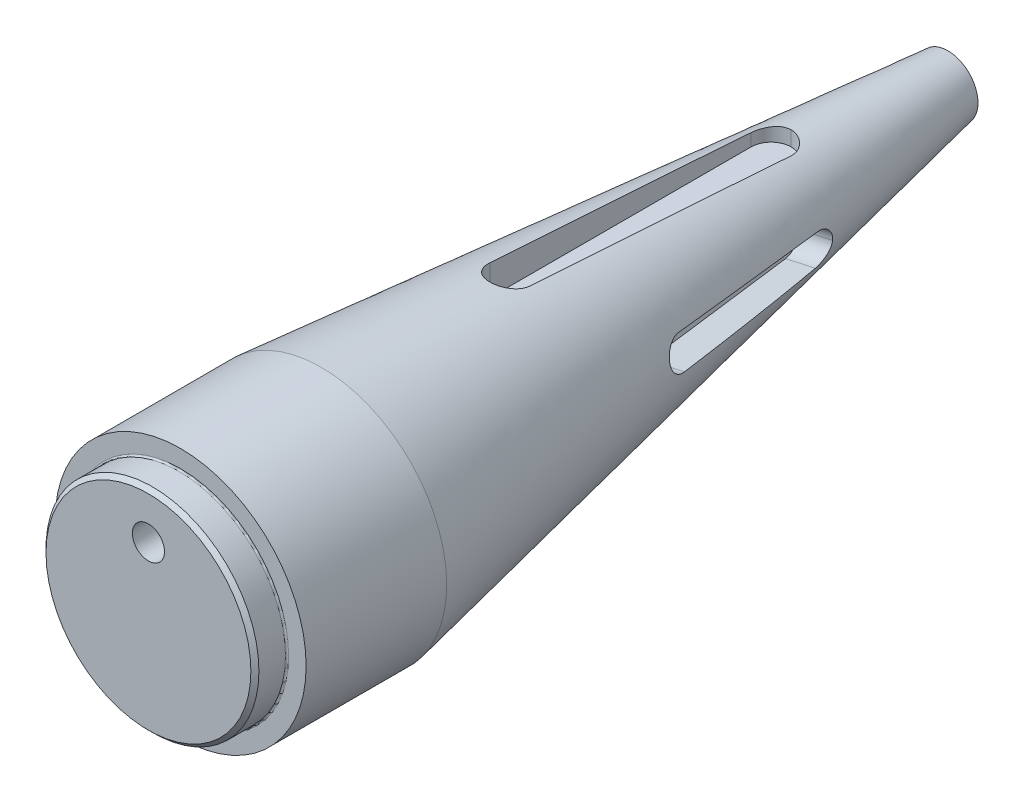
ISO-10303-21;
HEADER;
FILE_DESCRIPTION(('STEP AP214'),'2;1');
FILE_NAME('part.step','',(''),(''),'','','');
FILE_SCHEMA(('AUTOMOTIVE_DESIGN { 1 0 10303 214 1 1 1 1 }'));
ENDSEC;
DATA;
#1=APPLICATION_CONTEXT('core data for automotive mechanical design processes');
#2=APPLICATION_PROTOCOL_DEFINITION('international standard','automotive_design',2000,#1);
#3=PRODUCT_CONTEXT('',#1,'mechanical');
#4=PRODUCT('Part','Part','',(#3));
#5=PRODUCT_RELATED_PRODUCT_CATEGORY('part','',(#4));
#6=PRODUCT_DEFINITION_FORMATION('','',#4);
#7=PRODUCT_DEFINITION_CONTEXT('part definition',#1,'design');
#8=PRODUCT_DEFINITION('design','',#6,#7);
#9=PRODUCT_DEFINITION_SHAPE('','',#8);
#10=(LENGTH_UNIT() NAMED_UNIT(*) SI_UNIT(.MILLI.,.METRE.));
#11=(NAMED_UNIT(*) PLANE_ANGLE_UNIT() SI_UNIT($,.RADIAN.));
#12=(NAMED_UNIT(*) SI_UNIT($,.STERADIAN.) SOLID_ANGLE_UNIT());
#13=UNCERTAINTY_MEASURE_WITH_UNIT(LENGTH_MEASURE(1.E-05),#10,'distance_accuracy_value','');
#14=(GEOMETRIC_REPRESENTATION_CONTEXT(3) GLOBAL_UNCERTAINTY_ASSIGNED_CONTEXT((#13)) GLOBAL_UNIT_ASSIGNED_CONTEXT((#10,
#11,#12)) REPRESENTATION_CONTEXT('',''));
#15=CARTESIAN_POINT('',(0.,0.,0.));
#16=DIRECTION('',(0.,0.,1.));
#17=DIRECTION('',(1.,0.,0.));
#18=AXIS2_PLACEMENT_3D('',#15,#16,#17);
#19=CARTESIAN_POINT('',(-0.491673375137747,15.6172623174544,-175.5));
#20=CARTESIAN_POINT('',(0.,10.75,-253.5));
#21=CARTESIAN_POINT('',(0.159045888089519,15.6377487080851,-175.5));
#22=CARTESIAN_POINT('',(0.156250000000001,10.75,-253.5));
#23=CARTESIAN_POINT('',(0.852110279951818,15.6191672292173,-175.5));
#24=CARTESIAN_POINT('',(0.322750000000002,10.7405,-253.5));
#25=CARTESIAN_POINT('',(2.31942098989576,15.46947843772,-175.5));
#26=CARTESIAN_POINT('',(0.673625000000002,10.6935,-253.5));
#27=CARTESIAN_POINT('',(3.09388085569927,15.3382844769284,-175.5));
#28=CARTESIAN_POINT('',(0.858000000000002,10.656,-253.5));
#29=CARTESIAN_POINT('',(4.70777316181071,14.9221962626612,-175.5));
#30=CARTESIAN_POINT('',(1.242,10.544,-253.5));
#31=CARTESIAN_POINT('',(5.54742706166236,14.6370554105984,-175.5));
#32=CARTESIAN_POINT('',(1.44200000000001,10.469,-253.5));
#33=CARTESIAN_POINT('',(7.25570463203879,13.8698265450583,-175.5));
#34=CARTESIAN_POINT('',(1.84600000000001,10.272,-253.5));
#35=CARTESIAN_POINT('',(8.12443109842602,13.387281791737,-175.5));
#36=CARTESIAN_POINT('',(2.05,10.15,-253.5));
#37=CARTESIAN_POINT('',(9.82960628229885,12.1903459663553,-175.5));
#38=CARTESIAN_POINT('',(2.45,9.85,-253.5));
#39=CARTESIAN_POINT('',(10.6658362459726,11.4753520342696,-175.5));
#40=CARTESIAN_POINT('',(2.64519609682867,9.67217113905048,-253.5));
#41=CARTESIAN_POINT('',(12.2204406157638,9.8032952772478,-175.5));
#42=CARTESIAN_POINT('',(3.00548883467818,9.25933571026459,-253.5));
#43=CARTESIAN_POINT('',(12.9381201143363,8.84576164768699,-175.5));
#44=CARTESIAN_POINT('',(3.1704152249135,9.0242214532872,-253.5));
#45=CARTESIAN_POINT('',(14.15900315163,6.72049707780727,-175.5));
#46=CARTESIAN_POINT('',(3.44723183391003,8.50519031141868,-253.5));
#47=CARTESIAN_POINT('',(14.661177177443,5.55285190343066,-175.5));
#48=CARTESIAN_POINT('',(3.55887573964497,8.22130177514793,-253.5));
#49=CARTESIAN_POINT('',(15.3702305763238,3.08873639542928,-175.5));
#50=CARTESIAN_POINT('',(3.7103550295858,7.62485207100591,-253.5));
#51=CARTESIAN_POINT('',(15.5762895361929,1.79311190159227,-175.5));
#52=CARTESIAN_POINT('',(3.75,7.3125,-253.5));
#53=CARTESIAN_POINT('',(15.6582350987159,-0.809765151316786,-175.5));
#54=CARTESIAN_POINT('',(3.75,6.6875,-253.5));
#55=CARTESIAN_POINT('',(15.5340829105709,-2.11578557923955,-175.5));
#56=CARTESIAN_POINT('',(3.7103550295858,6.37514792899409,-253.5));
#57=CARTESIAN_POINT('',(14.9814340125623,-4.61962286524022,-175.5));
#58=CARTESIAN_POINT('',(3.55887573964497,5.77869822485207,-253.5));
#59=CARTESIAN_POINT('',(14.5537028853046,-5.8165439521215,-175.5));
#60=CARTESIAN_POINT('',(3.44723183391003,5.49480968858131,-253.5));
#61=CARTESIAN_POINT('',(13.4689232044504,-8.01439697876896,-175.5));
#62=CARTESIAN_POINT('',(3.17041522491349,4.9757785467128,-253.5));
#63=CARTESIAN_POINT('',(12.8128967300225,-9.01517856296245,-175.5));
#64=CARTESIAN_POINT('',(3.00548883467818,4.74066428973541,-253.5));
#65=CARTESIAN_POINT('',(11.3665484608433,-10.7817133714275,-175.5));
#66=CARTESIAN_POINT('',(2.64519609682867,4.32782886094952,-253.5));
#67=CARTESIAN_POINT('',(10.5769498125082,-11.5478927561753,-175.5));
#68=CARTESIAN_POINT('',(2.45,4.15,-253.5));
#69=CARTESIAN_POINT('',(8.95044236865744,-12.8497189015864,-175.5));
#70=CARTESIAN_POINT('',(2.04999999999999,3.85,-253.5));
#71=CARTESIAN_POINT('',(8.11378981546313,-13.3859535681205,-175.5));
#72=CARTESIAN_POINT('',(1.84599999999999,3.728,-253.5));
#73=CARTESIAN_POINT('',(6.45715626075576,-14.2591188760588,-175.5));
#74=CARTESIAN_POINT('',(1.44199999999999,3.531,-253.5));
#75=CARTESIAN_POINT('',(5.63710139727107,-14.5965118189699,-175.5));
#76=CARTESIAN_POINT('',(1.242,3.456,-253.5));
#77=CARTESIAN_POINT('',(4.05257838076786,-15.1132947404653,-175.5));
#78=CARTESIAN_POINT('',(0.857999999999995,3.344,-253.5));
#79=CARTESIAN_POINT('',(3.28790471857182,-15.2929447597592,-175.5));
#80=CARTESIAN_POINT('',(0.673624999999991,3.3065,-253.5));
#81=CARTESIAN_POINT('',(1.83291568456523,-15.5346353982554,-175.5));
#82=CARTESIAN_POINT('',(0.322749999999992,3.2595,-253.5));
#83=CARTESIAN_POINT('',(1.14239263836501,-15.5967759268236,-175.5));
#84=CARTESIAN_POINT('',(0.156249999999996,3.25,-253.5));
#85=CARTESIAN_POINT('',(-0.159045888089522,-15.6377487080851,-175.5));
#86=CARTESIAN_POINT('',(-0.156250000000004,3.25,-253.5));
#87=CARTESIAN_POINT('',(-0.852110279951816,-15.6191672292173,-175.5));
#88=CARTESIAN_POINT('',(-0.322750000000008,3.2595,-253.5));
#89=CARTESIAN_POINT('',(-2.31942098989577,-15.46947843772,-175.5));
#90=CARTESIAN_POINT('',(-0.673625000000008,3.3065,-253.5));
#91=CARTESIAN_POINT('',(-3.09388085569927,-15.3382844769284,-175.5));
#92=CARTESIAN_POINT('',(-0.858000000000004,3.344,-253.5));
#93=CARTESIAN_POINT('',(-4.70777316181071,-14.9221962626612,-175.5));
#94=CARTESIAN_POINT('',(-1.242,3.456,-253.5));
#95=CARTESIAN_POINT('',(-5.54742706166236,-14.6370554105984,-175.5));
#96=CARTESIAN_POINT('',(-1.44200000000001,3.53100000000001,-253.5));
#97=CARTESIAN_POINT('',(-7.25570463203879,-13.8698265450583,-175.5));
#98=CARTESIAN_POINT('',(-1.84600000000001,3.72800000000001,-253.5));
#99=CARTESIAN_POINT('',(-8.12443109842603,-13.387281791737,-175.5));
#100=CARTESIAN_POINT('',(-2.05,3.85,-253.5));
#101=CARTESIAN_POINT('',(-9.82960628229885,-12.1903459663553,-175.5));
#102=CARTESIAN_POINT('',(-2.45,4.15,-253.5));
#103=CARTESIAN_POINT('',(-10.6658362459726,-11.4753520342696,-175.5));
#104=CARTESIAN_POINT('',(-2.64519609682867,4.32782886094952,-253.5));
#105=CARTESIAN_POINT('',(-12.2204406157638,-9.8032952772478,-175.5));
#106=CARTESIAN_POINT('',(-3.00548883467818,4.74066428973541,-253.5));
#107=CARTESIAN_POINT('',(-12.9381201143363,-8.84576164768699,-175.5));
#108=CARTESIAN_POINT('',(-3.17041522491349,4.9757785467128,-253.5));
#109=CARTESIAN_POINT('',(-14.15900315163,-6.72049707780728,-175.5));
#110=CARTESIAN_POINT('',(-3.44723183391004,5.49480968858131,-253.5));
#111=CARTESIAN_POINT('',(-14.661177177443,-5.55285190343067,-175.5));
#112=CARTESIAN_POINT('',(-3.55887573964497,5.77869822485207,-253.5));
#113=CARTESIAN_POINT('',(-15.3702305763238,-3.08873639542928,-175.5));
#114=CARTESIAN_POINT('',(-3.7103550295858,6.37514792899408,-253.5));
#115=CARTESIAN_POINT('',(-15.5762895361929,-1.79311190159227,-175.5));
#116=CARTESIAN_POINT('',(-3.75,6.6875,-253.5));
#117=CARTESIAN_POINT('',(-15.6582350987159,0.809765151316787,-175.5));
#118=CARTESIAN_POINT('',(-3.75,7.3125,-253.5));
#119=CARTESIAN_POINT('',(-15.5340829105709,2.11578557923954,-175.5));
#120=CARTESIAN_POINT('',(-3.7103550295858,7.62485207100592,-253.5));
#121=CARTESIAN_POINT('',(-14.9814340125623,4.61962286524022,-175.5));
#122=CARTESIAN_POINT('',(-3.55887573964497,8.22130177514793,-253.5));
#123=CARTESIAN_POINT('',(-14.5537028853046,5.8165439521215,-175.5));
#124=CARTESIAN_POINT('',(-3.44723183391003,8.50519031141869,-253.5));
#125=CARTESIAN_POINT('',(-13.4689232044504,8.01439697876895,-175.5));
#126=CARTESIAN_POINT('',(-3.17041522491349,9.02422145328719,-253.5));
#127=CARTESIAN_POINT('',(-12.8128967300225,9.01517856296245,-175.5));
#128=CARTESIAN_POINT('',(-3.00548883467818,9.25933571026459,-253.5));
#129=CARTESIAN_POINT('',(-11.3665484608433,10.7817133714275,-175.5));
#130=CARTESIAN_POINT('',(-2.64519609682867,9.67217113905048,-253.5));
#131=CARTESIAN_POINT('',(-10.5769498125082,11.5478927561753,-175.5));
#132=CARTESIAN_POINT('',(-2.45,9.85,-253.5));
#133=CARTESIAN_POINT('',(-8.95044236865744,12.8497189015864,-175.5));
#134=CARTESIAN_POINT('',(-2.05,10.15,-253.5));
#135=CARTESIAN_POINT('',(-8.11378981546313,13.3859535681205,-175.5));
#136=CARTESIAN_POINT('',(-1.846,10.272,-253.5));
#137=CARTESIAN_POINT('',(-6.45715626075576,14.2591188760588,-175.5));
#138=CARTESIAN_POINT('',(-1.442,10.469,-253.5));
#139=CARTESIAN_POINT('',(-5.63710139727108,14.5965118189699,-175.5));
#140=CARTESIAN_POINT('',(-1.242,10.544,-253.5));
#141=CARTESIAN_POINT('',(-4.05257838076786,15.1132947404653,-175.5));
#142=CARTESIAN_POINT('',(-0.857999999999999,10.656,-253.5));
#143=CARTESIAN_POINT('',(-3.28790471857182,15.2929447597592,-175.5));
#144=CARTESIAN_POINT('',(-0.673624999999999,10.6935,-253.5));
#145=CARTESIAN_POINT('',(-1.83291568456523,15.5346353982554,-175.5));
#146=CARTESIAN_POINT('',(-0.322749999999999,10.7405,-253.5));
#147=CARTESIAN_POINT('',(-1.14239263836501,15.5967759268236,-175.5));
#148=CARTESIAN_POINT('',(-0.156249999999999,10.75,-253.5));
#149=CARTESIAN_POINT('',(-0.491673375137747,15.6172623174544,-175.5));
#150=CARTESIAN_POINT('',(0.,10.75,-253.5));
#151=B_SPLINE_SURFACE_WITH_KNOTS('',3,1,((#19,#20),(#21,#22),(#23,#24),(#25,#26),(#27,#28),(#29,
#30),(#31,#32),(#33,#34),(#35,#36),(#37,#38),(#39,#40),(#41,#42),(#43,#44),(#45,#46),(#47,#48),
(#49,#50),(#51,#52),(#53,#54),(#55,#56),(#57,#58),(#59,#60),(#61,#62),(#63,#64),(#65,#66),(#67,
#68),(#69,#70),(#71,#72),(#73,#74),(#75,#76),(#77,#78),(#79,#80),(#81,#82),(#83,#84),(#85,#86),
(#87,#88),(#89,#90),(#91,#92),(#93,#94),(#95,#96),(#97,#98),(#99,#100),(#101,#102),(#103,#104),
(#105,#106),(#107,#108),(#109,#110),(#111,#112),(#113,#114),(#115,#116),(#117,#118),(#119,#120),
(#121,#122),(#123,#124),(#125,#126),(#127,#128),(#129,#130),(#131,#132),(#133,#134),(#135,#136),
(#137,#138),(#139,#140),(#141,#142),(#143,#144),(#145,#146),(#147,#148),(#149,#150)),
.UNSPECIFIED.,.T.,.F.,.F.,(4,2,2,2,2,2,2,2,2,2,2,2,2,2,2,2,2,2,2,2,2,2,2,2,2,2,2,2,2,2,2,2,4),
(2,2),(0.,0.0312500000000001,0.0625000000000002,0.0937500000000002,0.125,0.15625,0.1875,0.21875,
0.25,0.28125,0.312500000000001,0.343750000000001,0.375000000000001,0.406250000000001,
0.437500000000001,0.468750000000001,0.500000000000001,0.531250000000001,0.562500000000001,
0.593750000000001,0.625000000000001,0.65625,0.6875,0.71875,0.75,0.78125,0.8125,0.84375,0.875,
0.90625,0.9375,0.96875,1.),(0.,1.),.UNSPECIFIED.);
#152=CARTESIAN_POINT('',(-6.8758701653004,2.42516434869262,-230.121051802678));
#153=CARTESIAN_POINT('',(-6.86558176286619,2.42394763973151,-230.171753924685));
#154=CARTESIAN_POINT('',(-6.85600513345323,2.42483354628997,-230.222650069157));
#155=CARTESIAN_POINT('',(-6.83836005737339,2.43078839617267,-230.324451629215));
#156=CARTESIAN_POINT('',(-6.83029140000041,2.435856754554,-230.37535704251));
#157=CARTESIAN_POINT('',(-6.81576954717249,2.45012885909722,-230.476634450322));
#158=CARTESIAN_POINT('',(-6.80931077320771,2.4593180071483,-230.527007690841));
#159=CARTESIAN_POINT('',(-6.79799690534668,2.48173198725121,-230.627016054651));
#160=CARTESIAN_POINT('',(-6.7931417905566,2.49495676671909,-230.676651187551));
#161=CARTESIAN_POINT('',(-6.78097392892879,2.54051297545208,-230.823913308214));
#162=CARTESIAN_POINT('',(-6.77604577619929,2.57873929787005,-230.91998809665));
#163=CARTESIAN_POINT('',(-6.77197875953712,2.66942657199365,-231.105246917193));
#164=CARTESIAN_POINT('',(-6.77284310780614,2.72189540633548,-231.194427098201));
#165=CARTESIAN_POINT('',(-6.77939539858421,2.84135364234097,-231.36683349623));
#166=CARTESIAN_POINT('',(-6.78524778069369,2.90877938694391,-231.449750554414));
#167=CARTESIAN_POINT('',(-6.80057345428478,3.0550794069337,-231.604414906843));
#168=CARTESIAN_POINT('',(-6.81004882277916,3.13396023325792,-231.676155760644));
#169=CARTESIAN_POINT('',(-6.83212684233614,3.30913065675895,-231.813177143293));
#170=CARTESIAN_POINT('',(-6.8449389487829,3.40635816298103,-231.877228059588));
#171=CARTESIAN_POINT('',(-6.87137606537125,3.6097949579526,-231.988622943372));
#172=CARTESIAN_POINT('',(-6.88500073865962,3.71600053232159,-232.035973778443));
#173=CARTESIAN_POINT('',(-6.91026797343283,3.92411001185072,-232.108734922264));
#174=CARTESIAN_POINT('',(-6.92197361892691,4.02540805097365,-232.135846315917));
#175=CARTESIAN_POINT('',(-6.93846543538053,4.17965482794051,-232.164716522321));
#176=CARTESIAN_POINT('',(-6.94378864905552,4.23149484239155,-232.172375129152));
#177=CARTESIAN_POINT('',(-6.95400166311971,4.33567070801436,-232.18366270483));
#178=CARTESIAN_POINT('',(-6.95889132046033,4.38800671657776,-232.187290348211));
#179=CARTESIAN_POINT('',(-6.96352546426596,4.4404503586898,-232.188859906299));
#180=B_SPLINE_CURVE_WITH_KNOTS('',3,(#152,#153,#154,#155,#156,#157,#158,#159,#160,#161,#162,
#163,#164,#165,#166,#167,#168,#169,#170,#171,#172,#173,#174,#175,#176,#177,#178,#179),
.UNSPECIFIED.,.F.,.F.,(4,2,2,2,2,2,2,2,2,2,2,2,2,4),(0.,0.155200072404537,0.310378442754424,
0.465011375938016,0.6196422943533,0.928629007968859,1.23778708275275,1.5575497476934,
1.87749600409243,2.22733140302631,2.57702277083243,2.89228748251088,3.0501651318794,
3.20809467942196),.UNSPECIFIED.);
#181=CARTESIAN_POINT('',(-6.87587016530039,2.42516434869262,-230.121051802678));
#182=VERTEX_POINT('',#181);
#183=CARTESIAN_POINT('',(-6.96352546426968,4.44045035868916,-232.1888599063));
#184=VERTEX_POINT('',#183);
#185=EDGE_CURVE('E70',#182,#184,#180,.T.);
#186=CARTESIAN_POINT('',(-6.96352546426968,4.44045035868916,-232.1888599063));
#187=CARTESIAN_POINT('',(-6.96836469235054,4.49512885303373,-232.190503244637));
#188=CARTESIAN_POINT('',(-6.97292041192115,4.54990227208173,-232.189897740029));
#189=CARTESIAN_POINT('',(-6.98143411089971,4.65926390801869,-232.184163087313));
#190=CARTESIAN_POINT('',(-6.98539202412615,4.7138521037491,-232.179033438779));
#191=CARTESIAN_POINT('',(-6.99267511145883,4.82240840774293,-232.164230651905));
#192=CARTESIAN_POINT('',(-6.99600083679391,4.87637701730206,-232.154561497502));
#193=CARTESIAN_POINT('',(-7.00202753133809,4.98332755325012,-232.130722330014));
#194=CARTESIAN_POINT('',(-7.00472854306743,5.03630954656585,-232.116552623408));
#195=CARTESIAN_POINT('',(-7.01196680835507,5.19332596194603,-232.06733914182));
#196=CARTESIAN_POINT('',(-7.01563675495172,5.2953917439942,-232.025596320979));
#197=CARTESIAN_POINT('',(-7.02135836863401,5.49095504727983,-231.925494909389));
#198=CARTESIAN_POINT('',(-7.02341050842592,5.58445506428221,-231.867141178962));
#199=CARTESIAN_POINT('',(-7.02691906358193,5.75975983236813,-231.736044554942));
#200=CARTESIAN_POINT('',(-7.02837948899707,5.84164077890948,-231.663403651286));
#201=CARTESIAN_POINT('',(-7.03188631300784,5.99235336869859,-231.505636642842));
#202=CARTESIAN_POINT('',(-7.033932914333,6.06118048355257,-231.420506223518));
#203=CARTESIAN_POINT('',(-7.03984220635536,6.1853079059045,-231.238425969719));
#204=CARTESIAN_POINT('',(-7.0437406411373,6.24030788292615,-231.141272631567));
#205=CARTESIAN_POINT('',(-7.05445606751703,6.3335541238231,-230.939405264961));
#206=CARTESIAN_POINT('',(-7.06127187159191,6.37180719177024,-230.834694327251));
#207=CARTESIAN_POINT('',(-7.07655999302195,6.42370713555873,-230.645906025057));
#208=CARTESIAN_POINT('',(-7.08426795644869,6.44102212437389,-230.562754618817));
#209=CARTESIAN_POINT('',(-7.10197349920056,6.46507167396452,-230.395242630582));
#210=CARTESIAN_POINT('',(-7.1119693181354,6.4718143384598,-230.310883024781));
#211=CARTESIAN_POINT('',(-7.12317930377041,6.47317858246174,-230.226558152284));
#212=B_SPLINE_CURVE_WITH_KNOTS('',3,(#186,#187,#188,#189,#190,#191,#192,#193,#194,#195,#196,
#197,#198,#199,#200,#201,#202,#203,#204,#205,#206,#207,#208,#209,#210,#211),.UNSPECIFIED.,.F.,
.F.,(4,2,2,2,2,2,2,2,2,2,2,2,4),(0.,0.16470662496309,0.32943147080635,0.494012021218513,
0.658581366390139,0.987837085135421,1.31699656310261,1.64388643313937,1.97088949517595,
2.30447805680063,2.63793095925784,2.89311368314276,3.14810071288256),.UNSPECIFIED.);
#213=CARTESIAN_POINT('',(-7.12317930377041,6.47317858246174,-230.226558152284));
#214=VERTEX_POINT('',#213);
#215=EDGE_CURVE('E377',#184,#214,#212,.T.);
#216=CARTESIAN_POINT('',(-9.96694681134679,6.82802000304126,-207.742492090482));
#217=CARTESIAN_POINT('',(-9.8113359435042,6.80849853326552,-209.015601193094));
#218=CARTESIAN_POINT('',(-9.65510284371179,6.7889116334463,-210.288633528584));
#219=CARTESIAN_POINT('',(-9.34114592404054,6.74958108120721,-212.834513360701));
#220=CARTESIAN_POINT('',(-9.18342210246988,6.72983742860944,-214.107360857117));
#221=CARTESIAN_POINT('',(-8.86623966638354,6.69016775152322,-216.65282212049));
#222=CARTESIAN_POINT('',(-8.70678107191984,6.67024172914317,-217.925435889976));
#223=CARTESIAN_POINT('',(-8.38579440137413,6.63017209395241,-220.470398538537));
#224=CARTESIAN_POINT('',(-8.22426632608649,6.61002848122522,-221.742747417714));
#225=CARTESIAN_POINT('',(-7.86216889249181,6.56492666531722,-224.572829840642));
#226=CARTESIAN_POINT('',(-7.66097845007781,6.53990316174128,-226.130483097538));
#227=CARTESIAN_POINT('',(-7.35557758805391,6.50198782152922,-228.466489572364));
#228=CARTESIAN_POINT('',(-7.25317440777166,6.48928598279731,-229.24508218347));
#229=CARTESIAN_POINT('',(-7.04697782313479,6.46373615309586,-230.802081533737));
#230=CARTESIAN_POINT('',(-6.94318441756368,6.45088816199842,-231.580488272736));
#231=CARTESIAN_POINT('',(-6.83860330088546,6.43795736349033,-232.358788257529));
#232=B_SPLINE_CURVE_WITH_KNOTS('',3,(#216,#217,#218,#219,#220,#221,#222,#223,#224,#225,#226,
#227,#228,#229,#230,#231),.UNSPECIFIED.,.F.,.F.,(4,2,2,2,2,2,2,4),(0.,3.84819770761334,
7.69639978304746,11.5445574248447,15.39271358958,20.1050827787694,22.4612836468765,
24.8174865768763),.UNSPECIFIED.);
#233=CARTESIAN_POINT('',(-9.64285717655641,6.78738170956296,-210.386241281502));
#234=VERTEX_POINT('',#233);
#235=EDGE_CURVE('E363',#234,#214,#232,.T.);
#236=CARTESIAN_POINT('',(-9.64285717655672,6.787381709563,-210.386241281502));
#237=CARTESIAN_POINT('',(-9.64955998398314,6.78822833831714,-210.331684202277));
#238=CARTESIAN_POINT('',(-9.65709469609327,6.78687134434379,-210.27719830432));
#239=CARTESIAN_POINT('',(-9.67375080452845,6.7797850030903,-210.168762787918));
#240=CARTESIAN_POINT('',(-9.68287200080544,6.77405620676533,-210.114813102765));
#241=CARTESIAN_POINT('',(-9.70260685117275,6.75827640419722,-210.007931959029));
#242=CARTESIAN_POINT('',(-9.71321762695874,6.74823365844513,-209.954998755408));
#243=CARTESIAN_POINT('',(-9.73582308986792,6.7239156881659,-209.850431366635));
#244=CARTESIAN_POINT('',(-9.74781777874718,6.70964045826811,-209.798797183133));
#245=CARTESIAN_POINT('',(-9.78568100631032,6.66060566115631,-209.646365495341));
#246=CARTESIAN_POINT('',(-9.81344459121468,6.61962433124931,-209.547953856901));
#247=CARTESIAN_POINT('',(-9.87259849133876,6.52231440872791,-209.360297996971));
#248=CARTESIAN_POINT('',(-9.90398950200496,6.46598287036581,-209.271055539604));
#249=CARTESIAN_POINT('',(-9.96936048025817,6.33842194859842,-209.102422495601));
#250=CARTESIAN_POINT('',(-10.0033749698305,6.26695913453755,-209.023221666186));
#251=CARTESIAN_POINT('',(-10.0717682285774,6.11156980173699,-208.878327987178));
#252=CARTESIAN_POINT('',(-10.1061471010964,6.02763965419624,-208.81263908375));
#253=CARTESIAN_POINT('',(-10.1743610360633,5.847209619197,-208.694898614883));
#254=CARTESIAN_POINT('',(-10.2081616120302,5.75045016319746,-208.643224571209));
#255=CARTESIAN_POINT('',(-10.272555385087,5.54859838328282,-208.557092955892));
#256=CARTESIAN_POINT('',(-10.3031506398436,5.4435114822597,-208.522624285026));
#257=CARTESIAN_POINT('',(-10.3514022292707,5.2591891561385,-208.479234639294));
#258=CARTESIAN_POINT('',(-10.3702380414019,5.18129277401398,-208.465803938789));
#259=CARTESIAN_POINT('',(-10.4051066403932,5.02390417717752,-208.4483002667));
#260=CARTESIAN_POINT('',(-10.4211415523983,4.94441322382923,-208.444220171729));
#261=CARTESIAN_POINT('',(-10.4355886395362,4.8646280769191,-208.444898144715));
#262=B_SPLINE_CURVE_WITH_KNOTS('',3,(#236,#237,#238,#239,#240,#241,#242,#243,#244,#245,#246,
#247,#248,#249,#250,#251,#252,#253,#254,#255,#256,#257,#258,#259,#260,#261),.UNSPECIFIED.,.F.,
.F.,(4,2,2,2,2,2,2,2,2,2,2,2,4),(0.,0.164866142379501,0.329711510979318,0.49424262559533,
0.658773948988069,0.987577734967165,1.316444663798,1.65081243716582,1.98527772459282,
2.32801625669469,2.67053340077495,2.91373850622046,3.15675827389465),.UNSPECIFIED.);
#263=CARTESIAN_POINT('',(-10.4355886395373,4.86462807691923,-208.444898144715));
#264=VERTEX_POINT('',#263);
#265=EDGE_CURVE('E12',#234,#264,#262,.T.);
#266=CARTESIAN_POINT('',(-10.4355886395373,4.86462807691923,-208.444898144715));
#267=CARTESIAN_POINT('',(-10.4454883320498,4.8100567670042,-208.445346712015));
#268=CARTESIAN_POINT('',(-10.4546495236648,4.75537149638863,-208.448017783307));
#269=CARTESIAN_POINT('',(-10.4714435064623,4.64616243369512,-208.457775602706));
#270=CARTESIAN_POINT('',(-10.4790763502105,4.59163863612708,-208.464862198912));
#271=CARTESIAN_POINT('',(-10.4927553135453,4.48319846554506,-208.483411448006));
#272=CARTESIAN_POINT('',(-10.498803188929,4.42928148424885,-208.494869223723));
#273=CARTESIAN_POINT('',(-10.5093076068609,4.3224010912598,-208.522079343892));
#274=CARTESIAN_POINT('',(-10.5137641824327,4.26943765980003,-208.53783159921));
#275=CARTESIAN_POINT('',(-10.5247533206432,4.11249208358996,-208.59141901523));
#276=CARTESIAN_POINT('',(-10.5289098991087,4.01041768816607,-208.635591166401));
#277=CARTESIAN_POINT('',(-10.5312332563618,3.81459341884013,-208.739580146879));
#278=CARTESIAN_POINT('',(-10.5294006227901,3.72084272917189,-208.799395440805));
#279=CARTESIAN_POINT('',(-10.5204772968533,3.54396866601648,-208.933301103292));
#280=CARTESIAN_POINT('',(-10.5133702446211,3.46087930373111,-209.007435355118));
#281=CARTESIAN_POINT('',(-10.4948752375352,3.30801679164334,-209.16792354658));
#282=CARTESIAN_POINT('',(-10.4834861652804,3.2382471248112,-209.254280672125));
#283=CARTESIAN_POINT('',(-10.4574291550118,3.11328308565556,-209.438036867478));
#284=CARTESIAN_POINT('',(-10.442724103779,3.0582704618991,-209.53555423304));
#285=CARTESIAN_POINT('',(-10.4113512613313,2.9655711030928,-209.738181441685));
#286=CARTESIAN_POINT('',(-10.3946845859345,2.92787457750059,-209.84328695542));
#287=CARTESIAN_POINT('',(-10.3656808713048,2.87948972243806,-210.02591598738));
#288=CARTESIAN_POINT('',(-10.3535444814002,2.86409197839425,-210.10225749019));
#289=CARTESIAN_POINT('',(-10.3292170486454,2.84255081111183,-210.256141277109));
#290=CARTESIAN_POINT('',(-10.3170260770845,2.83639762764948,-210.333682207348));
#291=CARTESIAN_POINT('',(-10.3049600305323,2.8349505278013,-210.411369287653));
#292=B_SPLINE_CURVE_WITH_KNOTS('',3,(#266,#267,#268,#269,#270,#271,#272,#273,#274,#275,#276,
#277,#278,#279,#280,#281,#282,#283,#284,#285,#286,#287,#288,#289,#290,#291),.UNSPECIFIED.,.F.,
.F.,(4,2,2,2,2,2,2,2,2,2,2,2,4),(0.,0.166339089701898,0.332672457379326,0.498820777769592,
0.664965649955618,0.997143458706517,1.32928867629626,1.66246845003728,1.9957352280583,
2.33293548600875,2.6699448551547,2.90587879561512,3.14156346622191),.UNSPECIFIED.);
#293=CARTESIAN_POINT('',(-10.3049600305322,2.83495052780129,-210.411369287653));
#294=VERTEX_POINT('',#293);
#295=EDGE_CURVE('E57',#264,#294,#292,.T.);
#296=CARTESIAN_POINT('',(-6.41168808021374,2.3707686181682,-232.349066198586));
#297=CARTESIAN_POINT('',(-6.49425058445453,2.38041676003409,-231.963842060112));
#298=CARTESIAN_POINT('',(-6.57559095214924,2.38993666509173,-231.57835442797));
#299=CARTESIAN_POINT('',(-6.73606270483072,2.4087446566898,-230.806916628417));
#300=CARTESIAN_POINT('',(-6.81519410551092,2.41803274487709,-230.420966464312));
#301=CARTESIAN_POINT('',(-6.97147785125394,2.43640112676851,-229.648694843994));
#302=CARTESIAN_POINT('',(-7.0486303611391,2.44548143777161,-229.262373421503));
#303=CARTESIAN_POINT('',(-7.20114945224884,2.4634545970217,-228.489373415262));
#304=CARTESIAN_POINT('',(-7.27651602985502,2.47234744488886,-228.10269483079));
#305=CARTESIAN_POINT('',(-7.50017185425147,2.49876939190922,-226.942198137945));
#306=CARTESIAN_POINT('',(-7.64602039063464,2.51604227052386,-226.167903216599));
#307=CARTESIAN_POINT('',(-7.93228779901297,2.55001752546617,-224.618460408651));
#308=CARTESIAN_POINT('',(-8.07270774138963,2.56672001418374,-223.843312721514));
#309=CARTESIAN_POINT('',(-8.34904301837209,2.59965197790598,-222.292190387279));
#310=CARTESIAN_POINT('',(-8.48495826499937,2.61588144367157,-221.516215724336));
#311=CARTESIAN_POINT('',(-8.75293577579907,2.64793571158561,-219.963589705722));
#312=CARTESIAN_POINT('',(-8.88499801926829,2.66376051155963,-219.186938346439));
#313=CARTESIAN_POINT('',(-9.11479808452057,2.69134064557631,-217.817667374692));
#314=CARTESIAN_POINT('',(-9.21323600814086,2.70316951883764,-217.225166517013));
#315=CARTESIAN_POINT('',(-9.40835026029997,2.72664219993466,-216.039876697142));
#316=CARTESIAN_POINT('',(-9.50502660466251,2.73828600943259,-215.447087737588));
#317=CARTESIAN_POINT('',(-9.69677557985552,2.76140514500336,-214.261249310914));
#318=CARTESIAN_POINT('',(-9.79184821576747,2.77288047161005,-213.668199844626));
#319=CARTESIAN_POINT('',(-9.98053963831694,2.7956786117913,-212.481772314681));
#320=CARTESIAN_POINT('',(-10.0741581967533,2.80700140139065,-211.888394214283));
#321=CARTESIAN_POINT('',(-10.2600420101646,2.82950479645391,-210.701421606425));
#322=CARTESIAN_POINT('',(-10.3523072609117,2.84068540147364,-210.107827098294));
#323=CARTESIAN_POINT('',(-10.5355925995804,2.8629157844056,-208.920440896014));
#324=CARTESIAN_POINT('',(-10.6266126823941,2.87396556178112,-208.326649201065));
#325=CARTESIAN_POINT('',(-10.7170640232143,2.88495557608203,-207.732770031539));
#326=B_SPLINE_CURVE_WITH_KNOTS('',3,(#296,#297,#298,#299,#300,#301,#302,#303,#304,#305,#306,
#307,#308,#309,#310,#311,#312,#313,#314,#315,#316,#317,#318,#319,#320,#321,#322,#323,#324,#325),
.UNSPECIFIED.,.F.,.F.,(4,2,2,2,2,2,2,2,2,2,2,2,2,2,4),(0.,1.18226701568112,2.36452562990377,
3.54668545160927,4.72884766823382,7.09312351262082,9.45693077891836,11.8207841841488,
14.1846502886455,15.9868642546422,17.7890620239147,19.5912540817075,21.393726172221,
23.1962038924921,24.9986890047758),.UNSPECIFIED.);
#327=EDGE_CURVE('E355',#182,#294,#326,.T.);
#328=CARTESIAN_POINT('',(2.5,13.8935339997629,-199.));
#329=CARTESIAN_POINT('',(2.50000736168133,13.898158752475,-198.929738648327));
#330=CARTESIAN_POINT('',(2.49703814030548,13.9034207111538,-198.859525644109));
#331=CARTESIAN_POINT('',(2.48522589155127,13.9151237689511,-198.719707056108));
#332=CARTESIAN_POINT('',(2.47638395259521,13.9215646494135,-198.65010136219));
#333=CARTESIAN_POINT('',(2.4529257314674,13.935520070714,-198.512100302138));
#334=CARTESIAN_POINT('',(2.43831939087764,13.9430327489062,-198.443703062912));
#335=CARTESIAN_POINT('',(2.40347538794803,13.9590018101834,-198.308489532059));
#336=CARTESIAN_POINT('',(2.3832375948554,13.9674582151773,-198.241673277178));
#337=CARTESIAN_POINT('',(2.31430742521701,13.9940122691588,-198.044302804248));
#338=CARTESIAN_POINT('',(2.25737299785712,14.0133100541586,-197.916679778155));
#339=CARTESIAN_POINT('',(2.12325879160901,14.05357868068,-197.67291255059));
#340=CARTESIAN_POINT('',(2.0460741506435,14.0745499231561,-197.556771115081));
#341=CARTESIAN_POINT('',(1.87201308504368,14.1168534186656,-197.337009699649));
#342=CARTESIAN_POINT('',(1.77482174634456,14.1381856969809,-197.233638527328));
#343=CARTESIAN_POINT('',(1.56414387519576,14.1790466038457,-197.044626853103));
#344=CARTESIAN_POINT('',(1.45065514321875,14.1985749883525,-196.958988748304));
#345=CARTESIAN_POINT('',(1.21029120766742,14.2341594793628,-196.807884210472));
#346=CARTESIAN_POINT('',(1.08340201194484,14.2502119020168,-196.74243914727));
#347=CARTESIAN_POINT('',(0.819922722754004,14.2773305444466,-196.63399566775));
#348=CARTESIAN_POINT('',(0.683341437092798,14.2884012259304,-196.590977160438));
#349=CARTESIAN_POINT('',(0.45483766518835,14.3016100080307,-196.540022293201));
#350=CARTESIAN_POINT('',(0.364529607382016,14.3055289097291,-196.525032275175));
#351=CARTESIAN_POINT('',(0.182830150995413,14.3107716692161,-196.5050183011));
#352=CARTESIAN_POINT('',(0.0914398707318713,14.3120980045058,-196.499984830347));
#353=CARTESIAN_POINT('',(0.,14.312071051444,-196.5));
#354=B_SPLINE_CURVE_WITH_KNOTS('',3,(#328,#329,#330,#331,#332,#333,#334,#335,#336,#337,#338,
#339,#340,#341,#342,#343,#344,#345,#346,#347,#348,#349,#350,#351,#352,#353),.UNSPECIFIED.,.F.,
.F.,(4,2,2,2,2,2,2,2,2,2,2,2,4),(0.,0.211164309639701,0.42228949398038,0.633052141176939,
0.84381968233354,1.26491028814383,1.68610209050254,2.11451490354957,2.54298559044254,
2.9719081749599,3.40044584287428,3.67478453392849,3.94886093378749),.UNSPECIFIED.);
#355=CARTESIAN_POINT('',(2.5,13.8935339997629,-199.));
#356=VERTEX_POINT('',#355);
#357=CARTESIAN_POINT('',(0.,14.312071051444,-196.5));
#358=VERTEX_POINT('',#357);
#359=EDGE_CURVE('E294',#356,#358,#354,.T.);
#360=CARTESIAN_POINT('',(0.,14.312071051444,-196.5));
#361=CARTESIAN_POINT('',(-0.068950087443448,14.3120675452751,-196.499992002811));
#362=CARTESIAN_POINT('',(-0.137895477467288,14.3113013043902,-196.502852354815));
#363=CARTESIAN_POINT('',(-0.275273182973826,14.3082904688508,-196.514247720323));
#364=CARTESIAN_POINT('',(-0.343705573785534,14.3060460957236,-196.522781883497));
#365=CARTESIAN_POINT('',(-0.479439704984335,14.3001319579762,-196.545440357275));
#366=CARTESIAN_POINT('',(-0.546743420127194,14.2964650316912,-196.559553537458));
#367=CARTESIAN_POINT('',(-0.679863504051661,14.2877859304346,-196.593237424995));
#368=CARTESIAN_POINT('',(-0.745679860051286,14.282773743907,-196.612808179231));
#369=CARTESIAN_POINT('',(-0.940207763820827,14.2658684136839,-196.67949254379));
#370=CARTESIAN_POINT('',(-1.06612196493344,14.252100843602,-196.734599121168));
#371=CARTESIAN_POINT('',(-1.30683446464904,14.2207426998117,-196.864369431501));
#372=CARTESIAN_POINT('',(-1.42163014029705,14.2031512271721,-196.939037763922));
#373=CARTESIAN_POINT('',(-1.63934448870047,14.1652413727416,-197.107427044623));
#374=CARTESIAN_POINT('',(-1.7419979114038,14.144877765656,-197.201481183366));
#375=CARTESIAN_POINT('',(-1.93026316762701,14.1033753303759,-197.405216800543));
#376=CARTESIAN_POINT('',(-2.01587003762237,14.0822362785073,-197.514902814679));
#377=CARTESIAN_POINT('',(-2.16957911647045,14.0404001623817,-197.749767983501));
#378=CARTESIAN_POINT('',(-2.23722730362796,14.0197248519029,-197.87524843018));
#379=CARTESIAN_POINT('',(-2.35031878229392,13.9810464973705,-198.136178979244));
#380=CARTESIAN_POINT('',(-2.39577844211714,13.9630414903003,-198.271621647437));
#381=CARTESIAN_POINT('',(-2.45279205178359,13.9359808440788,-198.506397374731));
#382=CARTESIAN_POINT('',(-2.4704552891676,13.9258695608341,-198.604167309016));
#383=CARTESIAN_POINT('',(-2.49406531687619,13.9079358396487,-198.801244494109));
#384=CARTESIAN_POINT('',(-2.50002044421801,13.9001117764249,-198.900550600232));
#385=CARTESIAN_POINT('',(-2.5,13.8935791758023,-199.));
#386=B_SPLINE_CURVE_WITH_KNOTS('',3,(#360,#361,#362,#363,#364,#365,#366,#367,#368,#369,#370,
#371,#372,#373,#374,#375,#376,#377,#378,#379,#380,#381,#382,#383,#384,#385),.UNSPECIFIED.,.F.,
.F.,(4,2,2,2,2,2,2,2,2,2,2,2,4),(0.,0.206778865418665,0.413526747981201,0.619864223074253,
0.826203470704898,1.23850964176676,1.6509128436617,2.07110457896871,2.49141848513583,
2.92151960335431,3.35130295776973,3.65021521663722,3.94891455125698),.UNSPECIFIED.);
#387=CARTESIAN_POINT('',(-2.5,13.8935791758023,-199.));
#388=VERTEX_POINT('',#387);
#389=EDGE_CURVE('E301',#358,#388,#386,.T.);
#390=CARTESIAN_POINT('',(-2.5,11.4854703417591,-234.));
#391=CARTESIAN_POINT('',(-2.5,11.5684631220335,-232.882144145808));
#392=CARTESIAN_POINT('',(-2.5,11.6503980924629,-231.764210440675));
#393=CARTESIAN_POINT('',(-2.5,11.8125319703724,-229.528218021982));
#394=CARTESIAN_POINT('',(-2.5,11.8927308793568,-228.410159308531));
#395=CARTESIAN_POINT('',(-2.5,12.0517720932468,-226.173949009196));
#396=CARTESIAN_POINT('',(-2.5,12.1306144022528,-225.055797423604));
#397=CARTESIAN_POINT('',(-2.5,12.2872002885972,-222.819417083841));
#398=CARTESIAN_POINT('',(-2.5,12.364943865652,-221.701188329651));
#399=CARTESIAN_POINT('',(-2.5,12.534702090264,-219.245174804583));
#400=CARTESIAN_POINT('',(-2.5,12.6265227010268,-217.907376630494));
#401=CARTESIAN_POINT('',(-2.5,12.809120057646,-215.23170906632));
#402=CARTESIAN_POINT('',(-2.5,12.8998968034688,-213.893839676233));
#403=CARTESIAN_POINT('',(-2.5,13.080595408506,-211.21804297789));
#404=CARTESIAN_POINT('',(-2.5,13.1705172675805,-209.880115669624));
#405=CARTESIAN_POINT('',(-2.5,13.3496522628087,-207.20420587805));
#406=CARTESIAN_POINT('',(-2.5,13.438865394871,-205.866223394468));
#407=CARTESIAN_POINT('',(-2.5,13.616698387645,-203.190219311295));
#408=CARTESIAN_POINT('',(-2.5,13.705318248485,-201.852197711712));
#409=CARTESIAN_POINT('',(-2.5,13.882052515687,-199.176121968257));
#410=CARTESIAN_POINT('',(-2.5,13.9701669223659,-197.838067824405));
#411=CARTESIAN_POINT('',(-2.49999999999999,14.05807255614,-196.5));
#412=B_SPLINE_CURVE_WITH_KNOTS('',3,(#390,#391,#392,#393,#394,#395,#396,#397,#398,#399,#400,
#401,#402,#403,#404,#405,#406,#407,#408,#409,#410,#411),.UNSPECIFIED.,.F.,.F.,(4,2,2,2,2,2,2,2,
2,2,4),(0.,3.36279580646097,6.72558869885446,10.0883714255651,13.4511550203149,17.4739911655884,
21.4968274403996,25.5196643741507,29.5425245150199,33.5653837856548,37.5882405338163),.UNSPECIFIED.);
#413=CARTESIAN_POINT('',(-2.5,11.669389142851,-231.500000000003));
#414=VERTEX_POINT('',#413);
#415=EDGE_CURVE('E271',#414,#388,#412,.T.);
#416=CARTESIAN_POINT('',(-2.5,11.6693891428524,-231.5));
#417=CARTESIAN_POINT('',(-2.50000907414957,11.6645136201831,-231.566712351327));
#418=CARTESIAN_POINT('',(-2.49732978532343,11.6606565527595,-231.63349729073));
#419=CARTESIAN_POINT('',(-2.48662750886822,11.6549756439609,-231.766714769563));
#420=CARTESIAN_POINT('',(-2.47860530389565,11.6531515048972,-231.833147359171));
#421=CARTESIAN_POINT('',(-2.45728160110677,11.6515337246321,-231.964988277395));
#422=CARTESIAN_POINT('',(-2.44399569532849,11.6517341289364,-232.03039904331));
#423=CARTESIAN_POINT('',(-2.41225662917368,11.6540599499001,-232.159900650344));
#424=CARTESIAN_POINT('',(-2.39380349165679,11.6561853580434,-232.2239914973));
#425=CARTESIAN_POINT('',(-2.33088465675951,11.6652562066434,-232.413600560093));
#426=CARTESIAN_POINT('',(-2.27884028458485,11.6748952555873,-232.5365734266));
#427=CARTESIAN_POINT('',(-2.15618279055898,11.6996357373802,-232.77222937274));
#428=CARTESIAN_POINT('',(-2.08556025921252,11.7147399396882,-232.884907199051));
#429=CARTESIAN_POINT('',(-1.92548200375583,11.7486737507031,-233.100315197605));
#430=CARTESIAN_POINT('',(-1.83555993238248,11.7675947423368,-233.2026846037));
#431=CARTESIAN_POINT('',(-1.64039184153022,11.806270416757,-233.391443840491));
#432=CARTESIAN_POINT('',(-1.53514077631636,11.8260253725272,-233.477828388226));
#433=CARTESIAN_POINT('',(-1.30692286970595,11.8646089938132,-233.635893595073));
#434=CARTESIAN_POINT('',(-1.18338431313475,11.8833599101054,-233.706770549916));
#435=CARTESIAN_POINT('',(-0.92562938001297,11.9163771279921,-233.826667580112));
#436=CARTESIAN_POINT('',(-0.791421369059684,11.9306469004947,-233.875704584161));
#437=CARTESIAN_POINT('',(-0.54758911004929,11.9502080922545,-233.94177456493));
#438=CARTESIAN_POINT('',(-0.439343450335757,11.9568052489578,-233.963557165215));
#439=CARTESIAN_POINT('',(-0.275434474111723,11.9634507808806,-233.985393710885));
#440=CARTESIAN_POINT('',(-0.220517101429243,11.9651242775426,-233.990866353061));
#441=CARTESIAN_POINT('',(-0.110404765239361,11.9673698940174,-233.998170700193));
#442=CARTESIAN_POINT('',(-0.0552097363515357,11.9679417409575,-234.000001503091));
#443=CARTESIAN_POINT('',(0.,11.9679546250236,-234.));
#444=B_SPLINE_CURVE_WITH_KNOTS('',3,(#416,#417,#418,#419,#420,#421,#422,#423,#424,#425,#426,
#427,#428,#429,#430,#431,#432,#433,#434,#435,#436,#437,#438,#439,#440,#441,#442,#443),
.UNSPECIFIED.,.F.,.F.,(4,2,2,2,2,2,2,2,2,2,2,2,2,4),(0.,0.200605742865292,0.401182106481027,
0.601168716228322,0.801154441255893,1.20077139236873,1.60059113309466,2.01145523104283,
2.42245487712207,2.85134454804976,3.27990119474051,3.6106648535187,3.77619119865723,
3.94175853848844),.UNSPECIFIED.);
#445=CARTESIAN_POINT('',(0.,11.9679546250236,-234.));
#446=VERTEX_POINT('',#445);
#447=EDGE_CURVE('E287',#414,#446,#444,.T.);
#448=CARTESIAN_POINT('',(0.,11.9679546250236,-234.));
#449=CARTESIAN_POINT('',(0.068713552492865,11.9679808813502,-234.000008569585));
#450=CARTESIAN_POINT('',(0.137422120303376,11.9671151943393,-233.99716723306));
#451=CARTESIAN_POINT('',(0.274315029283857,11.9636634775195,-233.98585118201));
#452=CARTESIAN_POINT('',(0.342499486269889,11.9610778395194,-233.97737775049));
#453=CARTESIAN_POINT('',(0.477678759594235,11.9542589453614,-233.954894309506));
#454=CARTESIAN_POINT('',(0.544676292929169,11.9500301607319,-233.940899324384));
#455=CARTESIAN_POINT('',(0.677180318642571,11.940073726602,-233.907509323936));
#456=CARTESIAN_POINT('',(0.742686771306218,11.934346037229,-233.88811416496));
#457=CARTESIAN_POINT('',(0.936248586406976,11.9151840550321,-233.822063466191));
#458=CARTESIAN_POINT('',(1.0615147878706,11.8997616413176,-233.767514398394));
#459=CARTESIAN_POINT('',(1.30115427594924,11.8655429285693,-233.639048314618));
#460=CARTESIAN_POINT('',(1.41552120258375,11.8467446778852,-233.565120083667));
#461=CARTESIAN_POINT('',(1.63377442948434,11.8076469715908,-233.397430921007));
#462=CARTESIAN_POINT('',(1.73726716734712,11.7873199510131,-233.303162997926));
#463=CARTESIAN_POINT('',(1.92726344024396,11.748459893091,-233.098485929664));
#464=CARTESIAN_POINT('',(2.01376537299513,11.7299270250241,-232.988075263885));
#465=CARTESIAN_POINT('',(2.16839553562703,11.6972100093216,-232.75227754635));
#466=CARTESIAN_POINT('',(2.23626198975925,11.6830874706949,-232.626709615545));
#467=CARTESIAN_POINT('',(2.34975511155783,11.6621056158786,-232.365386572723));
#468=CARTESIAN_POINT('',(2.39540317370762,11.6552393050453,-232.229641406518));
#469=CARTESIAN_POINT('',(2.45267586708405,11.6511507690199,-231.994276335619));
#470=CARTESIAN_POINT('',(2.47041525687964,11.6516397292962,-231.896148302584));
#471=CARTESIAN_POINT('',(2.48816301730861,11.6557642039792,-231.748032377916));
#472=CARTESIAN_POINT('',(2.4926020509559,11.6577047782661,-231.698498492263));
#473=CARTESIAN_POINT('',(2.49852172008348,11.6627092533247,-231.59929926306));
#474=CARTESIAN_POINT('',(2.50000167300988,11.6657734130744,-231.549633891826));
#475=CARTESIAN_POINT('',(2.5,11.6693951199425,-231.5));
#476=B_SPLINE_CURVE_WITH_KNOTS('',3,(#448,#449,#450,#451,#452,#453,#454,#455,#456,#457,#458,
#459,#460,#461,#462,#463,#464,#465,#466,#467,#468,#469,#470,#471,#472,#473,#474,#475),
.UNSPECIFIED.,.F.,.F.,(4,2,2,2,2,2,2,2,2,2,2,2,2,4),(0.,0.206067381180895,0.412087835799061,
0.617551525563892,0.823020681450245,1.23345246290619,1.64412229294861,2.0665437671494,
2.48900505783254,2.91712806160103,3.34483799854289,3.64318211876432,3.79240153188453,
3.94165536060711),.UNSPECIFIED.);
#477=CARTESIAN_POINT('',(2.5,11.6693951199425,-231.5));
#478=VERTEX_POINT('',#477);
#479=EDGE_CURVE('E279',#446,#478,#476,.T.);
#480=CARTESIAN_POINT('',(2.5,14.0580428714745,-196.5));
#481=CARTESIAN_POINT('',(2.5,13.889828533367,-199.059924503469));
#482=CARTESIAN_POINT('',(2.5,13.7208884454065,-201.619801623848));
#483=CARTESIAN_POINT('',(2.5,13.4658608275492,-205.459506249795));
#484=CARTESIAN_POINT('',(2.5,13.3805821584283,-206.739387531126));
#485=CARTESIAN_POINT('',(2.5,13.2093973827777,-209.299108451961));
#486=CARTESIAN_POINT('',(2.5,13.1234912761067,-210.578948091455));
#487=CARTESIAN_POINT('',(2.5,12.9542686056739,-213.089055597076));
#488=CARTESIAN_POINT('',(2.5,12.8709804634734,-214.319325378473));
#489=CARTESIAN_POINT('',(2.5,12.7035689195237,-216.779807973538));
#490=CARTESIAN_POINT('',(2.5,12.6194455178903,-218.010020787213));
#491=CARTESIAN_POINT('',(2.5,12.4501825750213,-220.470375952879));
#492=CARTESIAN_POINT('',(2.5,12.3650430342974,-221.700518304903));
#493=CARTESIAN_POINT('',(2.5,12.1935055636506,-224.160719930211));
#494=CARTESIAN_POINT('',(2.5,12.1071076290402,-225.390779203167));
#495=CARTESIAN_POINT('',(2.5,11.9327424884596,-227.850787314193));
#496=CARTESIAN_POINT('',(2.5,11.844775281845,-229.080736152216));
#497=CARTESIAN_POINT('',(2.5,11.6667856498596,-231.540487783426));
#498=CARTESIAN_POINT('',(2.5,11.5767632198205,-232.770290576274));
#499=CARTESIAN_POINT('',(2.5,11.485470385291,-234.));
#500=B_SPLINE_CURVE_WITH_KNOTS('',3,(#480,#481,#482,#483,#484,#485,#486,#487,#488,#489,#490,
#491,#492,#493,#494,#495,#496,#497,#498,#499),.UNSPECIFIED.,.F.,.F.,(4,2,2,2,2,2,2,2,2,4),(0.,
7.69633606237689,11.5444935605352,15.3926519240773,19.0919091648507,22.7911658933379,
26.4904207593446,30.1896894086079,33.8889595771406,37.5882381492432),.UNSPECIFIED.);
#501=EDGE_CURVE('E263',#356,#478,#500,.T.);
#502=CARTESIAN_POINT('',(0.,0.,-175.5));
#503=DIRECTION('',(0.,0.,1.));
#504=DIRECTION('',(1.,0.,0.));
#505=AXIS2_PLACEMENT_3D('',#502,#503,#504);
#506=CIRCLE('',#505,15.625);
#507=CARTESIAN_POINT('',(15.625,0.,-175.5));
#508=VERTEX_POINT('',#507);
#509=EDGE_CURVE('E221',#508,#508,#506,.T.);
#510=CARTESIAN_POINT('',(0.,7.,-253.5));
#511=DIRECTION('',(0.,0.,1.));
#512=DIRECTION('',(1.,0.,0.));
#513=AXIS2_PLACEMENT_3D('',#510,#511,#512);
#514=CIRCLE('',#513,3.75);
#515=CARTESIAN_POINT('',(3.75,7.,-253.5));
#516=VERTEX_POINT('',#515);
#517=EDGE_CURVE('E820',#516,#516,#514,.T.);
#518=CARTESIAN_POINT('',(10.304819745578,2.83493578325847,-210.411349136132));
#519=CARTESIAN_POINT('',(10.3134467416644,2.83598129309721,-210.355853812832));
#520=CARTESIAN_POINT('',(10.3221306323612,2.83941296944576,-210.300440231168));
#521=CARTESIAN_POINT('',(10.3395106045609,2.85100826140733,-210.190117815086));
#522=CARTESIAN_POINT('',(10.3482066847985,2.85917141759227,-210.135208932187));
#523=CARTESIAN_POINT('',(10.3741296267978,2.89065752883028,-209.97194755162));
#524=CARTESIAN_POINT('',(10.3912256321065,2.92098155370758,-209.864841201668));
#525=CARTESIAN_POINT('',(10.4239528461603,2.99935527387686,-209.657120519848));
#526=CARTESIAN_POINT('',(10.4395836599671,3.04740973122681,-209.556507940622));
#527=CARTESIAN_POINT('',(10.4681705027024,3.15981046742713,-209.364405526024));
#528=CARTESIAN_POINT('',(10.4811265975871,3.22415634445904,-209.272915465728));
#529=CARTESIAN_POINT('',(10.5031754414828,3.36762869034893,-209.101052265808));
#530=CARTESIAN_POINT('',(10.5122488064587,3.44682654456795,-209.020736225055));
#531=CARTESIAN_POINT('',(10.5253121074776,3.61750995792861,-208.873905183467));
#532=CARTESIAN_POINT('',(10.5293016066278,3.70899657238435,-208.807391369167));
#533=CARTESIAN_POINT('',(10.5313073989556,3.90112093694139,-208.69027348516));
#534=CARTESIAN_POINT('',(10.5293509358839,4.00171490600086,-208.639598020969));
#535=CARTESIAN_POINT('',(10.5189901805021,4.20943444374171,-208.555160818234));
#536=CARTESIAN_POINT('',(10.5105896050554,4.31655621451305,-208.52138934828));
#537=CARTESIAN_POINT('',(10.4911603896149,4.4977235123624,-208.479952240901));
#538=CARTESIAN_POINT('',(10.4819449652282,4.5708743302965,-208.467335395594));
#539=CARTESIAN_POINT('',(10.4607347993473,4.71761313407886,-208.450101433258));
#540=CARTESIAN_POINT('',(10.4487437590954,4.79120041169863,-208.445473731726));
#541=CARTESIAN_POINT('',(10.4354097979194,4.86460927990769,-208.444872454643));
#542=B_SPLINE_CURVE_WITH_KNOTS('',3,(#518,#519,#520,#521,#522,#523,#524,#525,#526,#527,#528,
#529,#530,#531,#532,#533,#534,#535,#536,#537,#538,#539,#540,#541),.UNSPECIFIED.,.F.,.F.,(4,2,2,
2,2,2,2,2,2,2,2,4),(0.,0.16840967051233,0.336802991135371,0.672932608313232,1.00915256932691,
1.34536423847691,1.68323535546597,2.02113550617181,2.35748977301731,2.69365018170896,
2.91760208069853,3.14125704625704),.UNSPECIFIED.);
#543=CARTESIAN_POINT('',(10.304819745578,2.83493578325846,-210.411349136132));
#544=VERTEX_POINT('',#543);
#545=CARTESIAN_POINT('',(10.4354097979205,4.86460927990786,-208.444872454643));
#546=VERTEX_POINT('',#545);
#547=EDGE_CURVE('E340',#544,#546,#542,.T.);
#548=CARTESIAN_POINT('',(10.4354097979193,4.86460927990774,-208.444872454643));
#549=CARTESIAN_POINT('',(10.4253109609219,4.92027178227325,-208.444408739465));
#550=CARTESIAN_POINT('',(10.4144574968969,4.97578710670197,-208.446247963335));
#551=CARTESIAN_POINT('',(10.3913514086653,5.08617440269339,-208.454496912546));
#552=CARTESIAN_POINT('',(10.3790990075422,5.14104647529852,-208.460905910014));
#553=CARTESIAN_POINT('',(10.340464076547,5.30394473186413,-208.486894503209));
#554=CARTESIAN_POINT('',(10.3121551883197,5.41051848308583,-208.513233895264));
#555=CARTESIAN_POINT('',(10.2517450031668,5.61662963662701,-208.583142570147));
#556=CARTESIAN_POINT('',(10.2196438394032,5.71616728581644,-208.62671124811));
#557=CARTESIAN_POINT('',(10.1531927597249,5.90573440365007,-208.729922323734));
#558=CARTESIAN_POINT('',(10.1188424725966,5.99576229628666,-208.789567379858));
#559=CARTESIAN_POINT('',(10.0492237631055,6.16509861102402,-208.924336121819));
#560=CARTESIAN_POINT('',(10.0139492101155,6.24425242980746,-208.999650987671));
#561=CARTESIAN_POINT('',(9.94482046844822,6.38833890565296,-209.163429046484));
#562=CARTESIAN_POINT('',(9.91096642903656,6.45327007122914,-209.251893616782));
#563=CARTESIAN_POINT('',(9.84667105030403,6.56683728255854,-209.439348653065));
#564=CARTESIAN_POINT('',(9.81621738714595,6.61553353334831,-209.538298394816));
#565=CARTESIAN_POINT('',(9.76025464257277,6.69543924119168,-209.744286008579));
#566=CARTESIAN_POINT('',(9.73474126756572,6.72666392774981,-209.851316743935));
#567=CARTESIAN_POINT('',(9.69812312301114,6.7626276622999,-210.030307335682));
#568=CARTESIAN_POINT('',(9.68515600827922,6.77287209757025,-210.100831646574));
#569=CARTESIAN_POINT('',(9.66194241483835,6.78580449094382,-210.242934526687));
#570=CARTESIAN_POINT('',(9.65169309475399,6.78850036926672,-210.31451191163));
#571=CARTESIAN_POINT('',(9.64288723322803,6.78738486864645,-210.386245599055));
#572=B_SPLINE_CURVE_WITH_KNOTS('',3,(#548,#549,#550,#551,#552,#553,#554,#555,#556,#557,#558,
#559,#560,#561,#562,#563,#564,#565,#566,#567,#568,#569,#570,#571),.UNSPECIFIED.,.F.,.F.,(4,2,2,
2,2,2,2,2,2,2,2,4),(0.,0.16961085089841,0.339194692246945,0.677563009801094,1.01591944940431,
1.35433187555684,1.69714458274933,2.03999322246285,2.38155593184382,2.72282044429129,
2.93970396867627,3.1563598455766),.UNSPECIFIED.);
#573=CARTESIAN_POINT('',(9.64288723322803,6.78738486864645,-210.386245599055));
#574=VERTEX_POINT('',#573);
#575=EDGE_CURVE('E347',#546,#574,#572,.T.);
#576=CARTESIAN_POINT('',(9.96692981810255,6.82801821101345,-207.742492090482));
#577=CARTESIAN_POINT('',(9.81134183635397,6.80849914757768,-209.015604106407));
#578=CARTESIAN_POINT('',(9.65513168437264,6.78891466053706,-210.288639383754));
#579=CARTESIAN_POINT('',(9.34121538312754,6.74958837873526,-212.83452453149));
#580=CARTESIAN_POINT('',(9.18350923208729,6.72984658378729,-214.107374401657));
#581=CARTESIAN_POINT('',(8.86635149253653,6.69017950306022,-216.652838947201));
#582=CARTESIAN_POINT('',(8.70689992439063,6.67025421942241,-217.925453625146));
#583=CARTESIAN_POINT('',(8.38591343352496,6.63018460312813,-220.470416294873));
#584=CARTESIAN_POINT('',(8.22437851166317,6.61004027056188,-221.742764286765));
#585=CARTESIAN_POINT('',(7.86223111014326,6.56493319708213,-224.57284187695));
#586=CARTESIAN_POINT('',(7.66098978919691,6.53990434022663,-226.130490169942));
#587=CARTESIAN_POINT('',(7.35552306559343,6.50198206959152,-228.466490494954));
#588=CARTESIAN_POINT('',(7.25309966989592,6.48927810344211,-229.24508130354));
#589=CARTESIAN_POINT('',(7.04687849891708,6.46372568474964,-230.802079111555));
#590=CARTESIAN_POINT('',(6.9430807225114,6.45087723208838,-231.580486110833));
#591=CARTESIAN_POINT('',(6.83850932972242,6.43794745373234,-232.358788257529));
#592=B_SPLINE_CURVE_WITH_KNOTS('',3,(#576,#577,#578,#579,#580,#581,#582,#583,#584,#585,#586,
#587,#588,#589,#590,#591),.UNSPECIFIED.,.F.,.F.,(4,2,2,2,2,2,2,4),(0.,3.84819795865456,
7.69640048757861,11.5445581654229,15.3927142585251,20.105088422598,22.4612919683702,
24.8174974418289),.UNSPECIFIED.);
#593=CARTESIAN_POINT('',(7.12309125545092,6.47316932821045,-230.226545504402));
#594=VERTEX_POINT('',#593);
#595=EDGE_CURVE('E309',#574,#594,#592,.T.);
#596=CARTESIAN_POINT('',(7.12309125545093,6.47316932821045,-230.226545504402));
#597=CARTESIAN_POINT('',(7.11569672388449,6.47225407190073,-230.282280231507));
#598=CARTESIAN_POINT('',(7.10881666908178,6.46900607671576,-230.338019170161));
#599=CARTESIAN_POINT('',(7.09607039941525,6.45787434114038,-230.449140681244));
#600=CARTESIAN_POINT('',(7.0902040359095,6.44999128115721,-230.504523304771));
#601=CARTESIAN_POINT('',(7.07411903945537,6.41946917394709,-230.66941699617));
#602=CARTESIAN_POINT('',(7.06538811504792,6.38995367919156,-230.777876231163));
#603=CARTESIAN_POINT('',(7.05136416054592,6.31329611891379,-230.988648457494));
#604=CARTESIAN_POINT('',(7.04607224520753,6.26614834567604,-231.090959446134));
#605=CARTESIAN_POINT('',(7.03997903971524,6.18320748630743,-231.237434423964));
#606=CARTESIAN_POINT('',(7.0382552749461,6.15351770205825,-231.285101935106));
#607=CARTESIAN_POINT('',(7.03526910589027,6.09021111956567,-231.377840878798));
#608=CARTESIAN_POINT('',(7.03400717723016,6.0565903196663,-231.422909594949));
#609=CARTESIAN_POINT('',(7.03068243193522,5.95009405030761,-231.553717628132));
#610=CARTESIAN_POINT('',(7.02908243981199,5.87161370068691,-231.635007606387));
#611=CARTESIAN_POINT('',(7.02580728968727,5.70190408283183,-231.782962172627));
#612=CARTESIAN_POINT('',(7.02413214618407,5.61067726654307,-231.849629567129));
#613=CARTESIAN_POINT('',(7.02067277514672,5.46708770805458,-231.936600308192));
#614=CARTESIAN_POINT('',(7.01937455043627,5.41847370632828,-231.963272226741));
#615=CARTESIAN_POINT('',(7.01634612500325,5.31918771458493,-232.012347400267));
#616=CARTESIAN_POINT('',(7.01461630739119,5.2685175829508,-232.034754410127));
#617=CARTESIAN_POINT('',(7.0106192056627,5.16546192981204,-232.075153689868));
#618=CARTESIAN_POINT('',(7.00835184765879,5.11307617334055,-232.093145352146));
#619=CARTESIAN_POINT('',(7.00322265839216,5.00699466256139,-232.124598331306));
#620=CARTESIAN_POINT('',(7.00036082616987,4.95329890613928,-232.138059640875));
#621=CARTESIAN_POINT('',(6.99275726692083,4.8236890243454,-232.164764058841));
#622=CARTESIAN_POINT('',(6.98771877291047,4.74733766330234,-232.175841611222));
#623=CARTESIAN_POINT('',(6.97646482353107,4.59406627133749,-232.189042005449));
#624=CARTESIAN_POINT('',(6.97025116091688,4.51714727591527,-232.191178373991));
#625=CARTESIAN_POINT('',(6.96346598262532,4.44044410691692,-232.188851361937));
#626=B_SPLINE_CURVE_WITH_KNOTS('',3,(#596,#597,#598,#599,#600,#601,#602,#603,#604,#605,#606,
#607,#608,#609,#610,#611,#612,#613,#614,#615,#616,#617,#618,#619,#620,#621,#622,#623,#624,#625),
.UNSPECIFIED.,.F.,.F.,(4,2,2,2,2,2,2,2,2,2,2,2,2,2,4),(0.,0.168590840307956,0.337156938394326,
0.673684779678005,1.01032165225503,1.17869933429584,1.34724993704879,1.68452551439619,
2.02173630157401,2.18796195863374,2.35404058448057,2.52014205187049,2.68624378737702,
2.9176345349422,3.14867509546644),.UNSPECIFIED.);
#627=CARTESIAN_POINT('',(6.96346598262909,4.44044410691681,-232.188851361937));
#628=VERTEX_POINT('',#627);
#629=EDGE_CURVE('E333',#594,#628,#626,.T.);
#630=CARTESIAN_POINT('',(6.96346598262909,4.44044410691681,-232.188851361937));
#631=CARTESIAN_POINT('',(6.958289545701,4.38170491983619,-232.187094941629));
#632=CARTESIAN_POINT('',(6.95279399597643,4.32310621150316,-232.18275743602));
#633=CARTESIAN_POINT('',(6.94127220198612,4.20657536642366,-232.169038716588));
#634=CARTESIAN_POINT('',(6.93524614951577,4.14864299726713,-232.159659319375));
#635=CARTESIAN_POINT('',(6.91656473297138,3.97670328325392,-232.124201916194));
#636=CARTESIAN_POINT('',(6.90327390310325,3.86419792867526,-232.090792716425));
#637=CARTESIAN_POINT('',(6.87628504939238,3.64651716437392,-232.005869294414));
#638=CARTESIAN_POINT('',(6.86258742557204,3.54133487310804,-231.954372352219));
#639=CARTESIAN_POINT('',(6.83635159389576,3.34058739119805,-231.834790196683));
#640=CARTESIAN_POINT('',(6.82381424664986,3.24502933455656,-231.766692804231));
#641=CARTESIAN_POINT('',(6.80149517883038,3.06344766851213,-231.613376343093));
#642=CARTESIAN_POINT('',(6.79180492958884,2.97778531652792,-231.527714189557));
#643=CARTESIAN_POINT('',(6.77782492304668,2.8221521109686,-231.342778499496));
#644=CARTESIAN_POINT('',(6.77353292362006,2.75217475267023,-231.243510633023));
#645=CARTESIAN_POINT('',(6.77234416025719,2.63343317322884,-231.038707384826));
#646=CARTESIAN_POINT('',(6.77512662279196,2.58386314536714,-230.933647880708));
#647=CARTESIAN_POINT('',(6.78517558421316,2.52394714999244,-230.771293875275));
#648=CARTESIAN_POINT('',(6.78950393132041,2.5063823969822,-230.716385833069));
#649=CARTESIAN_POINT('',(6.80016498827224,2.47623842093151,-230.605414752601));
#650=CARTESIAN_POINT('',(6.80649687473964,2.46365715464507,-230.549352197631));
#651=CARTESIAN_POINT('',(6.82185522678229,2.4426985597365,-230.431273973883));
#652=CARTESIAN_POINT('',(6.83107895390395,2.4348272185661,-230.369193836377));
#653=CARTESIAN_POINT('',(6.85178750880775,2.42531384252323,-230.244992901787));
#654=CARTESIAN_POINT('',(6.86327024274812,2.42366606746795,-230.182872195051));
#655=CARTESIAN_POINT('',(6.87582170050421,2.42515925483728,-230.121044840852));
#656=B_SPLINE_CURVE_WITH_KNOTS('',3,(#630,#631,#632,#633,#634,#635,#636,#637,#638,#639,#640,
#641,#642,#643,#644,#645,#646,#647,#648,#649,#650,#651,#652,#653,#654,#655),.UNSPECIFIED.,.F.,
.F.,(4,2,2,2,2,2,2,2,2,2,2,2,4),(0.,0.176856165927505,0.353648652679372,0.706176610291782,
1.05836869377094,1.41081994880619,1.77359482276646,2.13621897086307,2.4826967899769,
2.65591100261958,2.82905412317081,3.01846345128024,3.20769803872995),.UNSPECIFIED.);
#657=CARTESIAN_POINT('',(6.87582170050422,2.42515925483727,-230.121044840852));
#658=VERTEX_POINT('',#657);
#659=EDGE_CURVE('E325',#628,#658,#656,.T.);
#660=CARTESIAN_POINT('',(6.41174480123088,2.37077459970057,-232.349066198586));
#661=CARTESIAN_POINT('',(6.49403177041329,2.3803907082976,-231.965059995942));
#662=CARTESIAN_POINT('',(6.57509880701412,2.38987881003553,-231.58079131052));
#663=CARTESIAN_POINT('',(6.73503697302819,2.40862456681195,-230.811794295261));
#664=CARTESIAN_POINT('',(6.81390811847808,2.41788222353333,-230.427065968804));
#665=CARTESIAN_POINT('',(7.04758238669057,2.44534655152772,-229.272345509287));
#666=CARTESIAN_POINT('',(7.19946003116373,2.46324618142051,-228.501753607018));
#667=CARTESIAN_POINT('',(7.49682399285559,2.49837444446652,-226.959341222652));
#668=CARTESIAN_POINT('',(7.64231041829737,2.51560308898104,-226.187520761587));
#669=CARTESIAN_POINT('',(7.92787329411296,2.54949195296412,-224.643026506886));
#670=CARTESIAN_POINT('',(8.06795080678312,2.56615228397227,-223.870352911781));
#671=CARTESIAN_POINT('',(8.34355678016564,2.59899526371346,-222.324171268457));
#672=CARTESIAN_POINT('',(8.47908515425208,2.61517790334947,-221.550663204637));
#673=CARTESIAN_POINT('',(8.74628673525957,2.64713829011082,-220.002969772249));
#674=CARTESIAN_POINT('',(8.8779599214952,2.66291603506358,-219.228784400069));
#675=CARTESIAN_POINT('',(9.10781006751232,2.69050142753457,-217.859522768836));
#676=CARTESIAN_POINT('',(9.20667103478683,2.70238092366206,-217.264562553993));
#677=CARTESIAN_POINT('',(9.40261828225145,2.72595347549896,-216.074351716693));
#678=CARTESIAN_POINT('',(9.49970457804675,2.73764653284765,-215.479101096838));
#679=CARTESIAN_POINT('',(9.69226798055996,2.76086358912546,-214.288338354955));
#680=CARTESIAN_POINT('',(9.78774509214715,2.77238758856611,-213.692826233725));
#681=CARTESIAN_POINT('',(9.97724584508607,2.79528311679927,-212.501472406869));
#682=CARTESIAN_POINT('',(10.0712692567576,2.80665462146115,-211.905630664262));
#683=CARTESIAN_POINT('',(10.257970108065,2.82925621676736,-210.71373200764));
#684=CARTESIAN_POINT('',(10.3506475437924,2.84048630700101,-210.117675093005));
#685=CARTESIAN_POINT('',(10.5347598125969,2.86281592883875,-208.925364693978));
#686=CARTESIAN_POINT('',(10.6261946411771,2.87391545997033,-208.329111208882));
#687=CARTESIAN_POINT('',(10.7170596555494,2.88495511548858,-207.732770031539));
#688=B_SPLINE_CURVE_WITH_KNOTS('',3,(#660,#661,#662,#663,#664,#665,#666,#667,#668,#669,#670,
#671,#672,#673,#674,#675,#676,#677,#678,#679,#680,#681,#682,#683,#684,#685,#686,#687),
.UNSPECIFIED.,.F.,.F.,(4,2,2,2,2,2,2,2,2,2,2,2,2,4),(0.,1.17851896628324,2.35702932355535,
4.71385279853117,7.07063634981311,9.42695465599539,11.7833178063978,14.1396935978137,
15.9493953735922,17.7590812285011,19.5687616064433,21.37872504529,23.1886937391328,
24.9986689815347),.UNSPECIFIED.);
#689=EDGE_CURVE('E317',#658,#544,#688,.T.);
#690=ORIENTED_EDGE('',*,*,#185,.T.);
#691=ORIENTED_EDGE('',*,*,#215,.T.);
#692=ORIENTED_EDGE('',*,*,#235,.F.);
#693=ORIENTED_EDGE('',*,*,#265,.T.);
#694=ORIENTED_EDGE('',*,*,#295,.T.);
#695=ORIENTED_EDGE('',*,*,#327,.F.);
#696=EDGE_LOOP('',(#690,#691,#692,#693,#694,#695));
#697=FACE_BOUND('',#696,.T.);
#698=ORIENTED_EDGE('',*,*,#359,.T.);
#699=ORIENTED_EDGE('',*,*,#389,.T.);
#700=ORIENTED_EDGE('',*,*,#415,.F.);
#701=ORIENTED_EDGE('',*,*,#447,.T.);
#702=ORIENTED_EDGE('',*,*,#479,.T.);
#703=ORIENTED_EDGE('',*,*,#501,.F.);
#704=EDGE_LOOP('',(#698,#699,#700,#701,#702,#703));
#705=FACE_BOUND('',#704,.T.);
#706=ORIENTED_EDGE('',*,*,#509,.F.);
#707=EDGE_LOOP('',(#706));
#708=FACE_BOUND('',#707,.T.);
#709=ORIENTED_EDGE('',*,*,#517,.T.);
#710=EDGE_LOOP('',(#709));
#711=FACE_BOUND('',#710,.T.);
#712=ORIENTED_EDGE('',*,*,#547,.T.);
#713=ORIENTED_EDGE('',*,*,#575,.T.);
#714=ORIENTED_EDGE('',*,*,#595,.T.);
#715=ORIENTED_EDGE('',*,*,#629,.T.);
#716=ORIENTED_EDGE('',*,*,#659,.T.);
#717=ORIENTED_EDGE('',*,*,#689,.T.);
#718=EDGE_LOOP('',(#712,#713,#714,#715,#716,#717));
#719=FACE_BOUND('',#718,.T.);
#720=ADVANCED_FACE('F47',(#697,#705,#708,#711,#719),#151,.T.);
#721=CARTESIAN_POINT('',(0.,0.,-175.5));
#722=DIRECTION('',(0.,0.,1.));
#723=DIRECTION('',(1.,0.,0.));
#724=AXIS2_PLACEMENT_3D('',#721,#722,#723);
#725=CYLINDRICAL_SURFACE('',#724,15.625);
#726=ORIENTED_EDGE('',*,*,#509,.T.);
#727=EDGE_LOOP('',(#726));
#728=FACE_BOUND('',#727,.T.);
#729=CARTESIAN_POINT('',(0.,0.,-158.));
#730=DIRECTION('',(0.,0.,1.));
#731=DIRECTION('',(1.,0.,0.));
#732=AXIS2_PLACEMENT_3D('',#729,#730,#731);
#733=CIRCLE('',#732,15.625);
#734=CARTESIAN_POINT('',(15.625,0.,-158.));
#735=VERTEX_POINT('',#734);
#736=EDGE_CURVE('E469',#735,#735,#733,.T.);
#737=ORIENTED_EDGE('',*,*,#736,.F.);
#738=EDGE_LOOP('',(#737));
#739=FACE_BOUND('',#738,.T.);
#740=ADVANCED_FACE('F243',(#728,#739),#725,.T.);
#741=CARTESIAN_POINT('',(0.,0.,-158.));
#742=DIRECTION('',(0.,0.,1.));
#743=DIRECTION('',(1.,0.,0.));
#744=AXIS2_PLACEMENT_3D('',#741,#742,#743);
#745=PLANE('',#744);
#746=CARTESIAN_POINT('',(0.,0.,-158.));
#747=DIRECTION('',(0.,0.,1.));
#748=DIRECTION('',(1.,0.,0.));
#749=AXIS2_PLACEMENT_3D('',#746,#747,#748);
#750=CIRCLE('',#749,13.45);
#751=CARTESIAN_POINT('',(13.45,0.,-158.));
#752=VERTEX_POINT('',#751);
#753=EDGE_CURVE('E468',#752,#752,#750,.F.);
#754=ORIENTED_EDGE('',*,*,#753,.T.);
#755=EDGE_LOOP('',(#754));
#756=FACE_BOUND('',#755,.T.);
#757=ORIENTED_EDGE('',*,*,#736,.T.);
#758=EDGE_LOOP('',(#757));
#759=FACE_BOUND('',#758,.T.);
#760=ADVANCED_FACE('F452',(#756,#759),#745,.T.);
#761=CARTESIAN_POINT('',(0.,7.,-253.5));
#762=DIRECTION('',(0.,0.,1.));
#763=DIRECTION('',(1.,0.,0.));
#764=AXIS2_PLACEMENT_3D('',#761,#762,#763);
#765=PLANE('',#764);
#766=CARTESIAN_POINT('',(0.,7.,-253.5));
#767=DIRECTION('',(0.,0.,-1.));
#768=DIRECTION('',(-1.,0.,0.));
#769=AXIS2_PLACEMENT_3D('',#766,#767,#768);
#770=CIRCLE('',#769,2.25);
#771=CARTESIAN_POINT('',(-2.25,7.,-253.5));
#772=VERTEX_POINT('',#771);
#773=EDGE_CURVE('E187',#772,#772,#770,.T.);
#774=ORIENTED_EDGE('',*,*,#773,.F.);
#775=EDGE_LOOP('',(#774));
#776=FACE_BOUND('',#775,.T.);
#777=ORIENTED_EDGE('',*,*,#517,.F.);
#778=EDGE_LOOP('',(#777));
#779=FACE_BOUND('',#778,.T.);
#780=ADVANCED_FACE('F246',(#776,#779),#765,.F.);
#781=CARTESIAN_POINT('',(0.,0.,-154.));
#782=DIRECTION('',(0.,0.,-1.));
#783=DIRECTION('',(-1.,0.,0.));
#784=AXIS2_PLACEMENT_3D('',#781,#782,#783);
#785=CYLINDRICAL_SURFACE('',#784,13.25);
#786=CARTESIAN_POINT('',(0.,0.,-154.5));
#787=DIRECTION('',(0.,0.,1.));
#788=DIRECTION('',(1.,0.,0.));
#789=AXIS2_PLACEMENT_3D('',#786,#787,#788);
#790=CIRCLE('',#789,13.25);
#791=CARTESIAN_POINT('',(13.25,0.,-154.5));
#792=VERTEX_POINT('',#791);
#793=EDGE_CURVE('E474',#792,#792,#790,.F.);
#794=ORIENTED_EDGE('',*,*,#793,.T.);
#795=EDGE_LOOP('',(#794));
#796=FACE_BOUND('',#795,.T.);
#797=CARTESIAN_POINT('',(0.,0.,-157.8));
#798=DIRECTION('',(0.,0.,1.));
#799=DIRECTION('',(1.,0.,0.));
#800=AXIS2_PLACEMENT_3D('',#797,#798,#799);
#801=CIRCLE('',#800,13.25);
#802=CARTESIAN_POINT('',(13.25,0.,-157.8));
#803=VERTEX_POINT('',#802);
#804=EDGE_CURVE('E460',#803,#803,#801,.T.);
#805=ORIENTED_EDGE('',*,*,#804,.T.);
#806=EDGE_LOOP('',(#805));
#807=FACE_BOUND('',#806,.T.);
#808=ADVANCED_FACE('F244',(#796,#807),#785,.T.);
#809=CARTESIAN_POINT('',(0.,0.,-154.));
#810=DIRECTION('',(0.,0.,1.));
#811=DIRECTION('',(1.,0.,0.));
#812=AXIS2_PLACEMENT_3D('',#809,#810,#811);
#813=PLANE('',#812);
#814=CARTESIAN_POINT('',(0.,7.5,-154.));
#815=DIRECTION('',(0.,0.,1.));
#816=DIRECTION('',(1.,0.,0.));
#817=AXIS2_PLACEMENT_3D('',#814,#815,#816);
#818=CIRCLE('',#817,2.);
#819=CARTESIAN_POINT('',(2.,7.5,-154.));
#820=VERTEX_POINT('',#819);
#821=EDGE_CURVE('E188',#820,#820,#818,.T.);
#822=ORIENTED_EDGE('',*,*,#821,.F.);
#823=EDGE_LOOP('',(#822));
#824=FACE_BOUND('',#823,.T.);
#825=CARTESIAN_POINT('',(0.,0.,-154.));
#826=DIRECTION('',(0.,0.,1.));
#827=DIRECTION('',(1.,0.,0.));
#828=AXIS2_PLACEMENT_3D('',#825,#826,#827);
#829=CIRCLE('',#828,12.75);
#830=CARTESIAN_POINT('',(12.75,0.,-154.));
#831=VERTEX_POINT('',#830);
#832=EDGE_CURVE('E472',#831,#831,#829,.T.);
#833=ORIENTED_EDGE('',*,*,#832,.T.);
#834=EDGE_LOOP('',(#833));
#835=FACE_BOUND('',#834,.T.);
#836=ADVANCED_FACE('F448',(#824,#835),#813,.T.);
#837=CARTESIAN_POINT('',(0.,0.,-157.8));
#838=DIRECTION('',(0.,0.,1.));
#839=DIRECTION('',(1.,0.,0.));
#840=AXIS2_PLACEMENT_3D('',#837,#838,#839);
#841=TOROIDAL_SURFACE('',#840,13.45,0.2);
#842=ORIENTED_EDGE('',*,*,#753,.F.);
#843=EDGE_LOOP('',(#842));
#844=FACE_BOUND('',#843,.T.);
#845=ORIENTED_EDGE('',*,*,#804,.F.);
#846=EDGE_LOOP('',(#845));
#847=FACE_BOUND('',#846,.T.);
#848=ADVANCED_FACE('F444',(#844,#847),#841,.F.);
#849=CARTESIAN_POINT('',(0.,0.,-154.));
#850=DIRECTION('',(0.,0.,-1.));
#851=DIRECTION('',(-1.,0.,0.));
#852=AXIS2_PLACEMENT_3D('',#849,#850,#851);
#853=CONICAL_SURFACE('',#852,12.75,0.785398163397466);
#854=ORIENTED_EDGE('',*,*,#793,.F.);
#855=EDGE_LOOP('',(#854));
#856=FACE_BOUND('',#855,.T.);
#857=ORIENTED_EDGE('',*,*,#832,.F.);
#858=EDGE_LOOP('',(#857));
#859=FACE_BOUND('',#858,.T.);
#860=ADVANCED_FACE('F440',(#856,#859),#853,.T.);
#861=CARTESIAN_POINT('',(-2.5,10.125,-234.));
#862=DIRECTION('',(-1.,0.,0.));
#863=DIRECTION('',(0.,0.,1.));
#864=AXIS2_PLACEMENT_3D('',#861,#862,#863);
#865=PLANE('',#864);
#866=DIRECTION('',(0.,0.,1.));
#867=VECTOR('',#866,1.);
#868=CARTESIAN_POINT('',(-2.5,10.125,-234.));
#869=LINE('',#868,#867);
#870=CARTESIAN_POINT('',(-2.5,10.125,-231.5));
#871=VERTEX_POINT('',#870);
#872=CARTESIAN_POINT('',(-2.5,10.125,-199.));
#873=VERTEX_POINT('',#872);
#874=EDGE_CURVE('E217',#871,#873,#869,.T.);
#875=ORIENTED_EDGE('',*,*,#874,.F.);
#876=DIRECTION('',(0.,1.,0.));
#877=VECTOR('',#876,1.);
#878=CARTESIAN_POINT('',(-2.5,11.4854703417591,-231.5));
#879=LINE('',#878,#877);
#880=EDGE_CURVE('E503',#871,#414,#879,.T.);
#881=ORIENTED_EDGE('',*,*,#880,.T.);
#882=ORIENTED_EDGE('',*,*,#415,.T.);
#883=DIRECTION('',(0.,1.,0.));
#884=VECTOR('',#883,1.);
#885=CARTESIAN_POINT('',(-2.5,10.125,-199.));
#886=LINE('',#885,#884);
#887=EDGE_CURVE('E502',#388,#873,#886,.F.);
#888=ORIENTED_EDGE('',*,*,#887,.T.);
#889=EDGE_LOOP('',(#875,#881,#882,#888));
#890=FACE_BOUND('',#889,.T.);
#891=ADVANCED_FACE('F443',(#890),#865,.F.);
#892=CARTESIAN_POINT('',(2.5,10.125,-196.5));
#893=DIRECTION('',(1.,0.,0.));
#894=DIRECTION('',(0.,0.,-1.));
#895=AXIS2_PLACEMENT_3D('',#892,#893,#894);
#896=PLANE('',#895);
#897=ORIENTED_EDGE('',*,*,#501,.T.);
#898=DIRECTION('',(0.,1.,0.));
#899=VECTOR('',#898,1.);
#900=CARTESIAN_POINT('',(2.5,10.125,-231.5));
#901=LINE('',#900,#899);
#902=CARTESIAN_POINT('',(2.5,10.125,-231.5));
#903=VERTEX_POINT('',#902);
#904=EDGE_CURVE('E489',#478,#903,#901,.F.);
#905=ORIENTED_EDGE('',*,*,#904,.T.);
#906=DIRECTION('',(0.,0.,-1.));
#907=VECTOR('',#906,1.);
#908=CARTESIAN_POINT('',(2.5,10.125,-196.5));
#909=LINE('',#908,#907);
#910=CARTESIAN_POINT('',(2.5,10.125,-199.));
#911=VERTEX_POINT('',#910);
#912=EDGE_CURVE('E214',#911,#903,#909,.T.);
#913=ORIENTED_EDGE('',*,*,#912,.F.);
#914=DIRECTION('',(0.,1.,0.));
#915=VECTOR('',#914,1.);
#916=CARTESIAN_POINT('',(2.5,14.0580428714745,-199.));
#917=LINE('',#916,#915);
#918=EDGE_CURVE('E485',#911,#356,#917,.T.);
#919=ORIENTED_EDGE('',*,*,#918,.T.);
#920=EDGE_LOOP('',(#897,#905,#913,#919));
#921=FACE_BOUND('',#920,.T.);
#922=ADVANCED_FACE('F593',(#921),#896,.F.);
#923=CARTESIAN_POINT('',(0.,10.125,0.));
#924=DIRECTION('',(0.,1.,0.));
#925=DIRECTION('',(0.,0.,1.));
#926=AXIS2_PLACEMENT_3D('',#923,#924,#925);
#927=PLANE('',#926);
#928=ORIENTED_EDGE('',*,*,#912,.T.);
#929=CARTESIAN_POINT('',(0.,10.125,-231.5));
#930=DIRECTION('',(0.,1.,0.));
#931=DIRECTION('',(0.,0.,1.));
#932=AXIS2_PLACEMENT_3D('',#929,#930,#931);
#933=CIRCLE('',#932,2.5);
#934=CARTESIAN_POINT('',(0.,10.125,-234.));
#935=VERTEX_POINT('',#934);
#936=EDGE_CURVE('E500',#903,#935,#933,.T.);
#937=ORIENTED_EDGE('',*,*,#936,.T.);
#938=CARTESIAN_POINT('',(0.,10.125,-231.5));
#939=DIRECTION('',(0.,1.,0.));
#940=DIRECTION('',(0.,0.,1.));
#941=AXIS2_PLACEMENT_3D('',#938,#939,#940);
#942=CIRCLE('',#941,2.5);
#943=EDGE_CURVE('E498',#935,#871,#942,.T.);
#944=ORIENTED_EDGE('',*,*,#943,.T.);
#945=ORIENTED_EDGE('',*,*,#874,.T.);
#946=CARTESIAN_POINT('',(0.,10.125,-199.));
#947=DIRECTION('',(0.,1.,0.));
#948=DIRECTION('',(0.,0.,1.));
#949=AXIS2_PLACEMENT_3D('',#946,#947,#948);
#950=CIRCLE('',#949,2.5);
#951=CARTESIAN_POINT('',(0.,10.125,-196.5));
#952=VERTEX_POINT('',#951);
#953=EDGE_CURVE('E492',#873,#952,#950,.T.);
#954=ORIENTED_EDGE('',*,*,#953,.T.);
#955=CARTESIAN_POINT('',(0.,10.125,-199.));
#956=DIRECTION('',(0.,1.,0.));
#957=DIRECTION('',(0.,0.,1.));
#958=AXIS2_PLACEMENT_3D('',#955,#956,#957);
#959=CIRCLE('',#958,2.5);
#960=EDGE_CURVE('E496',#952,#911,#959,.T.);
#961=ORIENTED_EDGE('',*,*,#960,.T.);
#962=EDGE_LOOP('',(#928,#937,#944,#945,#954,#961));
#963=FACE_BOUND('',#962,.T.);
#964=ADVANCED_FACE('F434',(#963),#927,.T.);
#965=CARTESIAN_POINT('',(0.,10.125,-231.5));
#966=DIRECTION('',(0.,-1.,0.));
#967=DIRECTION('',(0.,0.,-1.));
#968=AXIS2_PLACEMENT_3D('',#965,#966,#967);
#969=CYLINDRICAL_SURFACE('',#968,2.5);
#970=ORIENTED_EDGE('',*,*,#880,.F.);
#971=ORIENTED_EDGE('',*,*,#943,.F.);
#972=DIRECTION('',(0.,1.,0.));
#973=VECTOR('',#972,1.);
#974=CARTESIAN_POINT('',(0.,10.125,-234.));
#975=LINE('',#974,#973);
#976=EDGE_CURVE('E218',#446,#935,#975,.F.);
#977=ORIENTED_EDGE('',*,*,#976,.F.);
#978=ORIENTED_EDGE('',*,*,#447,.F.);
#979=EDGE_LOOP('',(#970,#971,#977,#978));
#980=FACE_BOUND('',#979,.T.);
#981=ADVANCED_FACE('F431',(#980),#969,.F.);
#982=CARTESIAN_POINT('',(0.,10.125,-231.5));
#983=DIRECTION('',(0.,-1.,0.));
#984=DIRECTION('',(0.,0.,-1.));
#985=AXIS2_PLACEMENT_3D('',#982,#983,#984);
#986=CYLINDRICAL_SURFACE('',#985,2.5);
#987=ORIENTED_EDGE('',*,*,#936,.F.);
#988=ORIENTED_EDGE('',*,*,#904,.F.);
#989=ORIENTED_EDGE('',*,*,#479,.F.);
#990=ORIENTED_EDGE('',*,*,#976,.T.);
#991=EDGE_LOOP('',(#987,#988,#989,#990));
#992=FACE_BOUND('',#991,.T.);
#993=ADVANCED_FACE('F425',(#992),#986,.F.);
#994=CARTESIAN_POINT('',(0.,10.125,-199.));
#995=DIRECTION('',(0.,-1.,0.));
#996=DIRECTION('',(0.,0.,-1.));
#997=AXIS2_PLACEMENT_3D('',#994,#995,#996);
#998=CYLINDRICAL_SURFACE('',#997,2.5);
#999=DIRECTION('',(0.,1.,0.));
#1000=VECTOR('',#999,1.);
#1001=CARTESIAN_POINT('',(0.,14.05807255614,-196.5));
#1002=LINE('',#1001,#1000);
#1003=EDGE_CURVE('E213',#952,#358,#1002,.T.);
#1004=ORIENTED_EDGE('',*,*,#1003,.F.);
#1005=ORIENTED_EDGE('',*,*,#953,.F.);
#1006=ORIENTED_EDGE('',*,*,#887,.F.);
#1007=ORIENTED_EDGE('',*,*,#389,.F.);
#1008=EDGE_LOOP('',(#1004,#1005,#1006,#1007));
#1009=FACE_BOUND('',#1008,.T.);
#1010=ADVANCED_FACE('F421',(#1009),#998,.F.);
#1011=CARTESIAN_POINT('',(0.,10.125,-199.));
#1012=DIRECTION('',(0.,-1.,0.));
#1013=DIRECTION('',(0.,0.,-1.));
#1014=AXIS2_PLACEMENT_3D('',#1011,#1012,#1013);
#1015=CYLINDRICAL_SURFACE('',#1014,2.5);
#1016=ORIENTED_EDGE('',*,*,#960,.F.);
#1017=ORIENTED_EDGE('',*,*,#1003,.T.);
#1018=ORIENTED_EDGE('',*,*,#359,.F.);
#1019=ORIENTED_EDGE('',*,*,#918,.F.);
#1020=EDGE_LOOP('',(#1016,#1017,#1018,#1019));
#1021=FACE_BOUND('',#1020,.T.);
#1022=ADVANCED_FACE('F424',(#1021),#1015,.F.);
#1023=CARTESIAN_POINT('',(3.36827856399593,2.05156418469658,-231.637422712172));
#1024=DIRECTION('',(-0.104873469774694,0.994482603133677,-0.00243051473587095));
#1025=DIRECTION('',(-0.994485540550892,-0.104873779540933,0.));
#1026=AXIS2_PLACEMENT_3D('',#1023,#1024,#1025);
#1027=PLANE('',#1026);
#1028=ORIENTED_EDGE('',*,*,#689,.F.);
#1029=DIRECTION('',(0.984526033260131,0.103477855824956,-0.141424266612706));
#1030=VECTOR('',#1029,1.);
#1031=CARTESIAN_POINT('',(3.64906350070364,2.08601330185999,-229.657530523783));
#1032=LINE('',#1031,#1030);
#1033=CARTESIAN_POINT('',(3.64906350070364,2.08601330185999,-229.657530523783));
#1034=VERTEX_POINT('',#1033);
#1035=EDGE_CURVE('E519',#658,#1034,#1032,.F.);
#1036=ORIENTED_EDGE('',*,*,#1035,.T.);
#1037=DIRECTION('',(0.140392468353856,0.0172245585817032,0.989946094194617));
#1038=VECTOR('',#1037,1.);
#1039=CARTESIAN_POINT('',(3.36827856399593,2.05156418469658,-231.637422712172));
#1040=LINE('',#1039,#1038);
#1041=CARTESIAN_POINT('',(6.45691286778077,2.43050447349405,-209.858608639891));
#1042=VERTEX_POINT('',#1041);
#1043=EDGE_CURVE('E206',#1034,#1042,#1040,.T.);
#1044=ORIENTED_EDGE('',*,*,#1043,.T.);
#1045=DIRECTION('',(0.984526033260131,0.103477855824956,-0.141424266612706));
#1046=VECTOR('',#1045,1.);
#1047=CARTESIAN_POINT('',(10.3290140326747,2.83747870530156,-210.414824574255));
#1048=LINE('',#1047,#1046);
#1049=EDGE_CURVE('E516',#1042,#544,#1048,.T.);
#1050=ORIENTED_EDGE('',*,*,#1049,.T.);
#1051=EDGE_LOOP('',(#1028,#1036,#1044,#1050));
#1052=FACE_BOUND('',#1051,.T.);
#1053=ADVANCED_FACE('F429',(#1052),#1027,.T.);
#1054=CARTESIAN_POINT('',(6.3182039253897,6.44288400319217,-207.888438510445));
#1055=DIRECTION('',(0.104873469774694,-0.994482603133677,0.00243051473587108));
#1056=DIRECTION('',(0.994485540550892,0.104873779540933,0.));
#1057=AXIS2_PLACEMENT_3D('',#1054,#1055,#1056);
#1058=PLANE('',#1057);
#1059=DIRECTION('',(-0.140392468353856,-0.0172245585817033,-0.989946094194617));
#1060=VECTOR('',#1059,1.);
#1061=CARTESIAN_POINT('',(6.3182039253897,6.44288400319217,-207.888438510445));
#1062=LINE('',#1061,#1060);
#1063=CARTESIAN_POINT('',(6.03741898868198,6.40843488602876,-209.868330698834));
#1064=VERTEX_POINT('',#1063);
#1065=CARTESIAN_POINT('',(3.22956962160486,6.06394371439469,-229.667252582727));
#1066=VERTEX_POINT('',#1065);
#1067=EDGE_CURVE('E209',#1064,#1066,#1062,.T.);
#1068=ORIENTED_EDGE('',*,*,#1067,.T.);
#1069=DIRECTION('',(0.984526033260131,0.103477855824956,-0.141424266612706));
#1070=VECTOR('',#1069,1.);
#1071=CARTESIAN_POINT('',(7.13943962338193,6.47488761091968,-230.228893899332));
#1072=LINE('',#1071,#1070);
#1073=EDGE_CURVE('E534',#1066,#594,#1072,.T.);
#1074=ORIENTED_EDGE('',*,*,#1073,.T.);
#1075=ORIENTED_EDGE('',*,*,#595,.F.);
#1076=DIRECTION('',(0.984526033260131,0.103477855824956,-0.141424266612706));
#1077=VECTOR('',#1076,1.);
#1078=CARTESIAN_POINT('',(6.03741898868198,6.40843488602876,-209.868330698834));
#1079=LINE('',#1078,#1077);
#1080=EDGE_CURVE('E533',#574,#1064,#1079,.F.);
#1081=ORIENTED_EDGE('',*,*,#1080,.T.);
#1082=EDGE_LOOP('',(#1068,#1074,#1075,#1081));
#1083=FACE_BOUND('',#1082,.T.);
#1084=ADVANCED_FACE('F585',(#1083),#1058,.T.);
#1085=CARTESIAN_POINT('',(35.7260888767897,3.75496325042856,-5.13194750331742));
#1086=DIRECTION('',(-0.984526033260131,-0.103477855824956,0.141424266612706));
#1087=DIRECTION('',(0.14218756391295,0.,0.989839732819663));
#1088=AXIS2_PLACEMENT_3D('',#1085,#1086,#1087);
#1089=PLANE('',#1088);
#1090=ORIENTED_EDGE('',*,*,#1043,.F.);
#1091=CARTESIAN_POINT('',(3.43931656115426,4.07497850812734,-229.662391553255));
#1092=DIRECTION('',(-0.984526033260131,-0.103477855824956,0.141424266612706));
#1093=DIRECTION('',(0.14218756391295,0.,0.989839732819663));
#1094=AXIS2_PLACEMENT_3D('',#1091,#1092,#1093);
#1095=CIRCLE('',#1094,2.);
#1096=CARTESIAN_POINT('',(3.15853162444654,4.04052939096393,-231.642283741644));
#1097=VERTEX_POINT('',#1096);
#1098=EDGE_CURVE('E531',#1034,#1097,#1095,.F.);
#1099=ORIENTED_EDGE('',*,*,#1098,.T.);
#1100=CARTESIAN_POINT('',(3.43931656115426,4.07497850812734,-229.662391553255));
#1101=DIRECTION('',(-0.984526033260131,-0.103477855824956,0.141424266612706));
#1102=DIRECTION('',(0.14218756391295,0.,0.989839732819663));
#1103=AXIS2_PLACEMENT_3D('',#1100,#1101,#1102);
#1104=CIRCLE('',#1103,2.);
#1105=EDGE_CURVE('E529',#1097,#1066,#1104,.F.);
#1106=ORIENTED_EDGE('',*,*,#1105,.T.);
#1107=ORIENTED_EDGE('',*,*,#1067,.F.);
#1108=CARTESIAN_POINT('',(6.24716592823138,4.41946967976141,-209.863469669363));
#1109=DIRECTION('',(-0.984526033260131,-0.103477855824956,0.141424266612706));
#1110=DIRECTION('',(0.14218756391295,0.,0.989839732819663));
#1111=AXIS2_PLACEMENT_3D('',#1108,#1109,#1110);
#1112=CIRCLE('',#1111,2.);
#1113=CARTESIAN_POINT('',(6.52795086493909,4.45391879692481,-207.883577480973));
#1114=VERTEX_POINT('',#1113);
#1115=EDGE_CURVE('E523',#1064,#1114,#1112,.F.);
#1116=ORIENTED_EDGE('',*,*,#1115,.T.);
#1117=CARTESIAN_POINT('',(6.24716592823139,4.41946967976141,-209.863469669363));
#1118=DIRECTION('',(-0.984526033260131,-0.103477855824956,0.141424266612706));
#1119=DIRECTION('',(0.14218756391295,0.,0.989839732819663));
#1120=AXIS2_PLACEMENT_3D('',#1117,#1118,#1119);
#1121=CIRCLE('',#1120,2.);
#1122=EDGE_CURVE('E527',#1114,#1042,#1121,.F.);
#1123=ORIENTED_EDGE('',*,*,#1122,.T.);
#1124=EDGE_LOOP('',(#1090,#1099,#1106,#1107,#1116,#1123));
#1125=FACE_BOUND('',#1124,.T.);
#1126=ADVANCED_FACE('F416',(#1125),#1089,.F.);
#1127=CARTESIAN_POINT('',(3.43931656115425,4.07497850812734,-229.662391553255));
#1128=DIRECTION('',(-0.984526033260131,-0.103477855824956,0.141424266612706));
#1129=DIRECTION('',(0.14218756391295,0.,0.989839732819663));
#1130=AXIS2_PLACEMENT_3D('',#1127,#1128,#1129);
#1131=CYLINDRICAL_SURFACE('',#1130,2.);
#1132=ORIENTED_EDGE('',*,*,#1073,.F.);
#1133=ORIENTED_EDGE('',*,*,#1105,.F.);
#1134=DIRECTION('',(0.984526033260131,0.103477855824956,-0.141424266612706));
#1135=VECTOR('',#1134,1.);
#1136=CARTESIAN_POINT('',(3.15853162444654,4.04052939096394,-231.642283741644));
#1137=LINE('',#1136,#1135);
#1138=EDGE_CURVE('E210',#628,#1097,#1137,.F.);
#1139=ORIENTED_EDGE('',*,*,#1138,.F.);
#1140=ORIENTED_EDGE('',*,*,#629,.F.);
#1141=EDGE_LOOP('',(#1132,#1133,#1139,#1140));
#1142=FACE_BOUND('',#1141,.T.);
#1143=ADVANCED_FACE('F413',(#1142),#1131,.F.);
#1144=CARTESIAN_POINT('',(3.43931656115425,4.07497850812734,-229.662391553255));
#1145=DIRECTION('',(-0.984526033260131,-0.103477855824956,0.141424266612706));
#1146=DIRECTION('',(0.14218756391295,0.,0.989839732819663));
#1147=AXIS2_PLACEMENT_3D('',#1144,#1145,#1146);
#1148=CYLINDRICAL_SURFACE('',#1147,2.);
#1149=ORIENTED_EDGE('',*,*,#1098,.F.);
#1150=ORIENTED_EDGE('',*,*,#1035,.F.);
#1151=ORIENTED_EDGE('',*,*,#659,.F.);
#1152=ORIENTED_EDGE('',*,*,#1138,.T.);
#1153=EDGE_LOOP('',(#1149,#1150,#1151,#1152));
#1154=FACE_BOUND('',#1153,.T.);
#1155=ADVANCED_FACE('F407',(#1154),#1148,.F.);
#1156=CARTESIAN_POINT('',(6.24716592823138,4.41946967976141,-209.863469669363));
#1157=DIRECTION('',(-0.984526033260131,-0.103477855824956,0.141424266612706));
#1158=DIRECTION('',(0.14218756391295,0.,0.989839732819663));
#1159=AXIS2_PLACEMENT_3D('',#1156,#1157,#1158);
#1160=CYLINDRICAL_SURFACE('',#1159,2.);
#1161=DIRECTION('',(0.984526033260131,0.103477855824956,-0.141424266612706));
#1162=VECTOR('',#1161,1.);
#1163=CARTESIAN_POINT('',(10.0961465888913,4.82895127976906,-208.396138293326));
#1164=LINE('',#1163,#1162);
#1165=EDGE_CURVE('E205',#1114,#546,#1164,.T.);
#1166=ORIENTED_EDGE('',*,*,#1165,.F.);
#1167=ORIENTED_EDGE('',*,*,#1115,.F.);
#1168=ORIENTED_EDGE('',*,*,#1080,.F.);
#1169=ORIENTED_EDGE('',*,*,#575,.F.);
#1170=EDGE_LOOP('',(#1166,#1167,#1168,#1169));
#1171=FACE_BOUND('',#1170,.T.);
#1172=ADVANCED_FACE('F403',(#1171),#1160,.F.);
#1173=CARTESIAN_POINT('',(6.24716592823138,4.41946967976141,-209.863469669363));
#1174=DIRECTION('',(-0.984526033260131,-0.103477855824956,0.141424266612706));
#1175=DIRECTION('',(0.14218756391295,0.,0.989839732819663));
#1176=AXIS2_PLACEMENT_3D('',#1173,#1174,#1175);
#1177=CYLINDRICAL_SURFACE('',#1176,2.);
#1178=ORIENTED_EDGE('',*,*,#1122,.F.);
#1179=ORIENTED_EDGE('',*,*,#1165,.T.);
#1180=ORIENTED_EDGE('',*,*,#547,.F.);
#1181=ORIENTED_EDGE('',*,*,#1049,.F.);
#1182=EDGE_LOOP('',(#1178,#1179,#1180,#1181));
#1183=FACE_BOUND('',#1182,.T.);
#1184=ADVANCED_FACE('F406',(#1183),#1177,.F.);
#1185=CARTESIAN_POINT('',(-6.3182039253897,6.44288400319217,-207.888438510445));
#1186=DIRECTION('',(0.104873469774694,0.994482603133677,-0.00243051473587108));
#1187=DIRECTION('',(-0.994485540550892,0.104873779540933,0.));
#1188=AXIS2_PLACEMENT_3D('',#1185,#1186,#1187);
#1189=PLANE('',#1188);
#1190=ORIENTED_EDGE('',*,*,#235,.T.);
#1191=DIRECTION('',(-0.984526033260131,0.103477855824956,-0.141424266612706));
#1192=VECTOR('',#1191,1.);
#1193=CARTESIAN_POINT('',(-3.22956962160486,6.06394371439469,-229.667252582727));
#1194=LINE('',#1193,#1192);
#1195=CARTESIAN_POINT('',(-3.22956962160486,6.06394371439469,-229.667252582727));
#1196=VERTEX_POINT('',#1195);
#1197=EDGE_CURVE('E562',#214,#1196,#1194,.F.);
#1198=ORIENTED_EDGE('',*,*,#1197,.T.);
#1199=DIRECTION('',(0.140392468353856,-0.0172245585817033,-0.989946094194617));
#1200=VECTOR('',#1199,1.);
#1201=CARTESIAN_POINT('',(-6.3182039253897,6.44288400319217,-207.888438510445));
#1202=LINE('',#1201,#1200);
#1203=CARTESIAN_POINT('',(-6.03741898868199,6.40843488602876,-209.868330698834));
#1204=VERTEX_POINT('',#1203);
#1205=EDGE_CURVE('E198',#1204,#1196,#1202,.T.);
#1206=ORIENTED_EDGE('',*,*,#1205,.F.);
#1207=DIRECTION('',(-0.984526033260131,0.103477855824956,-0.141424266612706));
#1208=VECTOR('',#1207,1.);
#1209=CARTESIAN_POINT('',(-9.60561947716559,6.78346786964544,-210.380892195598));
#1210=LINE('',#1209,#1208);
#1211=EDGE_CURVE('E561',#1204,#234,#1210,.T.);
#1212=ORIENTED_EDGE('',*,*,#1211,.T.);
#1213=EDGE_LOOP('',(#1190,#1198,#1206,#1212));
#1214=FACE_BOUND('',#1213,.T.);
#1215=ADVANCED_FACE('F411',(#1214),#1189,.F.);
#1216=CARTESIAN_POINT('',(-3.36827856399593,2.05156418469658,-231.637422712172));
#1217=DIRECTION('',(-0.104873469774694,-0.994482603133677,0.00243051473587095));
#1218=DIRECTION('',(0.994485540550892,-0.104873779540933,0.));
#1219=AXIS2_PLACEMENT_3D('',#1216,#1217,#1218);
#1220=PLANE('',#1219);
#1221=DIRECTION('',(-0.140392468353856,0.0172245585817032,0.989946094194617));
#1222=VECTOR('',#1221,1.);
#1223=CARTESIAN_POINT('',(-3.36827856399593,2.05156418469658,-231.637422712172));
#1224=LINE('',#1223,#1222);
#1225=CARTESIAN_POINT('',(-3.64906350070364,2.08601330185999,-229.657530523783));
#1226=VERTEX_POINT('',#1225);
#1227=CARTESIAN_POINT('',(-6.45691286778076,2.43050447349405,-209.858608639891));
#1228=VERTEX_POINT('',#1227);
#1229=EDGE_CURVE('E201',#1226,#1228,#1224,.T.);
#1230=ORIENTED_EDGE('',*,*,#1229,.F.);
#1231=DIRECTION('',(-0.984526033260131,0.103477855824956,-0.141424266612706));
#1232=VECTOR('',#1231,1.);
#1233=CARTESIAN_POINT('',(-6.74934845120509,2.41186638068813,-230.102877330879));
#1234=LINE('',#1233,#1232);
#1235=EDGE_CURVE('E549',#1226,#182,#1234,.T.);
#1236=ORIENTED_EDGE('',*,*,#1235,.T.);
#1237=ORIENTED_EDGE('',*,*,#327,.T.);
#1238=DIRECTION('',(-0.984526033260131,0.103477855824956,-0.141424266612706));
#1239=VECTOR('',#1238,1.);
#1240=CARTESIAN_POINT('',(-6.45691286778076,2.43050447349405,-209.858608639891));
#1241=LINE('',#1240,#1239);
#1242=EDGE_CURVE('E546',#294,#1228,#1241,.F.);
#1243=ORIENTED_EDGE('',*,*,#1242,.T.);
#1244=EDGE_LOOP('',(#1230,#1236,#1237,#1243));
#1245=FACE_BOUND('',#1244,.T.);
#1246=ADVANCED_FACE('F576',(#1245),#1220,.F.);
#1247=CARTESIAN_POINT('',(-35.7260888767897,3.75496325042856,-5.13194750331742));
#1248=DIRECTION('',(0.984526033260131,-0.103477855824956,0.141424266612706));
#1249=DIRECTION('',(-0.14218756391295,0.,0.989839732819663));
#1250=AXIS2_PLACEMENT_3D('',#1247,#1248,#1249);
#1251=PLANE('',#1250);
#1252=CARTESIAN_POINT('',(-3.43931656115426,4.07497850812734,-229.662391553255));
#1253=DIRECTION('',(0.984526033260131,-0.103477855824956,0.141424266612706));
#1254=DIRECTION('',(0.14218756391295,0.,-0.989839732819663));
#1255=AXIS2_PLACEMENT_3D('',#1252,#1253,#1254);
#1256=CIRCLE('',#1255,2.);
#1257=CARTESIAN_POINT('',(-3.15853162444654,4.04052939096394,-231.642283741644));
#1258=VERTEX_POINT('',#1257);
#1259=EDGE_CURVE('E557',#1196,#1258,#1256,.F.);
#1260=ORIENTED_EDGE('',*,*,#1259,.T.);
#1261=CARTESIAN_POINT('',(-3.43931656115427,4.07497850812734,-229.662391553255));
#1262=DIRECTION('',(0.984526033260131,-0.103477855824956,0.141424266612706));
#1263=DIRECTION('',(0.14218756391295,0.,-0.989839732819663));
#1264=AXIS2_PLACEMENT_3D('',#1261,#1262,#1263);
#1265=CIRCLE('',#1264,2.);
#1266=EDGE_CURVE('E559',#1258,#1226,#1265,.F.);
#1267=ORIENTED_EDGE('',*,*,#1266,.T.);
#1268=ORIENTED_EDGE('',*,*,#1229,.T.);
#1269=CARTESIAN_POINT('',(-6.24716592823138,4.41946967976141,-209.863469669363));
#1270=DIRECTION('',(0.984526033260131,-0.103477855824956,0.141424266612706));
#1271=DIRECTION('',(0.14218756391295,0.,-0.989839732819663));
#1272=AXIS2_PLACEMENT_3D('',#1269,#1270,#1271);
#1273=CIRCLE('',#1272,2.);
#1274=CARTESIAN_POINT('',(-6.52795086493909,4.45391879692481,-207.883577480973));
#1275=VERTEX_POINT('',#1274);
#1276=EDGE_CURVE('E555',#1228,#1275,#1273,.F.);
#1277=ORIENTED_EDGE('',*,*,#1276,.T.);
#1278=CARTESIAN_POINT('',(-6.24716592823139,4.41946967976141,-209.863469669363));
#1279=DIRECTION('',(0.984526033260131,-0.103477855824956,0.141424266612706));
#1280=DIRECTION('',(0.14218756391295,0.,-0.989839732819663));
#1281=AXIS2_PLACEMENT_3D('',#1278,#1279,#1280);
#1282=CIRCLE('',#1281,2.);
#1283=EDGE_CURVE('E551',#1275,#1204,#1282,.F.);
#1284=ORIENTED_EDGE('',*,*,#1283,.T.);
#1285=ORIENTED_EDGE('',*,*,#1205,.T.);
#1286=EDGE_LOOP('',(#1260,#1267,#1268,#1277,#1284,#1285));
#1287=FACE_BOUND('',#1286,.T.);
#1288=ADVANCED_FACE('F398',(#1287),#1251,.F.);
#1289=CARTESIAN_POINT('',(-3.43931656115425,4.07497850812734,-229.662391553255));
#1290=DIRECTION('',(0.984526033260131,-0.103477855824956,0.141424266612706));
#1291=DIRECTION('',(0.14218756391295,0.,-0.989839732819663));
#1292=AXIS2_PLACEMENT_3D('',#1289,#1290,#1291);
#1293=CYLINDRICAL_SURFACE('',#1292,2.);
#1294=DIRECTION('',(-0.984526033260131,0.103477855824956,-0.141424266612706));
#1295=VECTOR('',#1294,1.);
#1296=CARTESIAN_POINT('',(-7.0684946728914,4.45148306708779,-232.203938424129));
#1297=LINE('',#1296,#1295);
#1298=EDGE_CURVE('E202',#1258,#184,#1297,.T.);
#1299=ORIENTED_EDGE('',*,*,#1298,.F.);
#1300=ORIENTED_EDGE('',*,*,#1259,.F.);
#1301=ORIENTED_EDGE('',*,*,#1197,.F.);
#1302=ORIENTED_EDGE('',*,*,#215,.F.);
#1303=EDGE_LOOP('',(#1299,#1300,#1301,#1302));
#1304=FACE_BOUND('',#1303,.T.);
#1305=ADVANCED_FACE('F394',(#1304),#1293,.F.);
#1306=CARTESIAN_POINT('',(-3.43931656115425,4.07497850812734,-229.662391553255));
#1307=DIRECTION('',(0.984526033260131,-0.103477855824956,0.141424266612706));
#1308=DIRECTION('',(0.14218756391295,0.,-0.989839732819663));
#1309=AXIS2_PLACEMENT_3D('',#1306,#1307,#1308);
#1310=CYLINDRICAL_SURFACE('',#1309,2.);
#1311=ORIENTED_EDGE('',*,*,#1266,.F.);
#1312=ORIENTED_EDGE('',*,*,#1298,.T.);
#1313=ORIENTED_EDGE('',*,*,#185,.F.);
#1314=ORIENTED_EDGE('',*,*,#1235,.F.);
#1315=EDGE_LOOP('',(#1311,#1312,#1313,#1314));
#1316=FACE_BOUND('',#1315,.T.);
#1317=ADVANCED_FACE('F397',(#1316),#1310,.F.);
#1318=CARTESIAN_POINT('',(-6.24716592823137,4.4194696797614,-209.863469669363));
#1319=DIRECTION('',(0.984526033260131,-0.103477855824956,0.141424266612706));
#1320=DIRECTION('',(0.14218756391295,0.,-0.989839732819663));
#1321=AXIS2_PLACEMENT_3D('',#1318,#1319,#1320);
#1322=CYLINDRICAL_SURFACE('',#1321,2.);
#1323=ORIENTED_EDGE('',*,*,#1211,.F.);
#1324=ORIENTED_EDGE('',*,*,#1283,.F.);
#1325=DIRECTION('',(-0.984526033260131,0.103477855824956,-0.141424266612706));
#1326=VECTOR('',#1325,1.);
#1327=CARTESIAN_POINT('',(-6.52795086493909,4.45391879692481,-207.883577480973));
#1328=LINE('',#1327,#1326);
#1329=EDGE_CURVE('E52',#264,#1275,#1328,.F.);
#1330=ORIENTED_EDGE('',*,*,#1329,.F.);
#1331=ORIENTED_EDGE('',*,*,#265,.F.);
#1332=EDGE_LOOP('',(#1323,#1324,#1330,#1331));
#1333=FACE_BOUND('',#1332,.T.);
#1334=ADVANCED_FACE('F49',(#1333),#1322,.F.);
#1335=CARTESIAN_POINT('',(-6.24716592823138,4.4194696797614,-209.863469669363));
#1336=DIRECTION('',(0.984526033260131,-0.103477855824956,0.141424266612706));
#1337=DIRECTION('',(0.14218756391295,0.,-0.989839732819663));
#1338=AXIS2_PLACEMENT_3D('',#1335,#1336,#1337);
#1339=CYLINDRICAL_SURFACE('',#1338,2.);
#1340=ORIENTED_EDGE('',*,*,#1276,.F.);
#1341=ORIENTED_EDGE('',*,*,#1242,.F.);
#1342=ORIENTED_EDGE('',*,*,#295,.F.);
#1343=ORIENTED_EDGE('',*,*,#1329,.T.);
#1344=EDGE_LOOP('',(#1340,#1341,#1342,#1343));
#1345=FACE_BOUND('',#1344,.T.);
#1346=ADVANCED_FACE('F389',(#1345),#1339,.F.);
#1347=CARTESIAN_POINT('',(0.,7.,-247.5));
#1348=DIRECTION('',(0.,0.,-1.));
#1349=DIRECTION('',(-1.,0.,0.));
#1350=AXIS2_PLACEMENT_3D('',#1347,#1348,#1349);
#1351=CONICAL_SURFACE('',#1350,2.25,1.02974425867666);
#1352=CARTESIAN_POINT('',(0.,7.,-246.148063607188));
#1353=VERTEX_POINT('',#1352);
#1354=VERTEX_LOOP('',#1353);
#1355=FACE_BOUND('',#1354,.T.);
#1356=CARTESIAN_POINT('',(0.,7.,-247.5));
#1357=DIRECTION('',(0.,0.,-1.));
#1358=DIRECTION('',(-1.,0.,0.));
#1359=AXIS2_PLACEMENT_3D('',#1356,#1357,#1358);
#1360=CIRCLE('',#1359,2.25);
#1361=CARTESIAN_POINT('',(-2.25,7.,-247.5));
#1362=VERTEX_POINT('',#1361);
#1363=EDGE_CURVE('E191',#1362,#1362,#1360,.T.);
#1364=ORIENTED_EDGE('',*,*,#1363,.T.);
#1365=EDGE_LOOP('',(#1364));
#1366=FACE_BOUND('',#1365,.T.);
#1367=ADVANCED_FACE('F392',(#1355,#1366),#1351,.F.);
#1368=CARTESIAN_POINT('',(0.,7.,-253.5));
#1369=DIRECTION('',(0.,0.,-1.));
#1370=DIRECTION('',(-1.,0.,0.));
#1371=AXIS2_PLACEMENT_3D('',#1368,#1369,#1370);
#1372=CYLINDRICAL_SURFACE('',#1371,2.25);
#1373=ORIENTED_EDGE('',*,*,#1363,.F.);
#1374=EDGE_LOOP('',(#1373));
#1375=FACE_BOUND('',#1374,.T.);
#1376=ORIENTED_EDGE('',*,*,#773,.T.);
#1377=EDGE_LOOP('',(#1376));
#1378=FACE_BOUND('',#1377,.T.);
#1379=ADVANCED_FACE('F181',(#1375,#1378),#1372,.F.);
#1380=CARTESIAN_POINT('',(0.,7.5,-160.));
#1381=DIRECTION('',(0.,0.,1.));
#1382=DIRECTION('',(1.,0.,0.));
#1383=AXIS2_PLACEMENT_3D('',#1380,#1381,#1382);
#1384=CONICAL_SURFACE('',#1383,2.,1.02974425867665);
#1385=CARTESIAN_POINT('',(0.,7.5,-161.201721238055));
#1386=VERTEX_POINT('',#1385);
#1387=VERTEX_LOOP('',#1386);
#1388=FACE_BOUND('',#1387,.T.);
#1389=CARTESIAN_POINT('',(0.,7.5,-160.));
#1390=DIRECTION('',(0.,0.,1.));
#1391=DIRECTION('',(1.,0.,0.));
#1392=AXIS2_PLACEMENT_3D('',#1389,#1390,#1391);
#1393=CIRCLE('',#1392,2.);
#1394=CARTESIAN_POINT('',(2.,7.5,-160.));
#1395=VERTEX_POINT('',#1394);
#1396=EDGE_CURVE('E185',#1395,#1395,#1393,.T.);
#1397=ORIENTED_EDGE('',*,*,#1396,.T.);
#1398=EDGE_LOOP('',(#1397));
#1399=FACE_BOUND('',#1398,.T.);
#1400=ADVANCED_FACE('F177',(#1388,#1399),#1384,.F.);
#1401=CARTESIAN_POINT('',(0.,7.5,-154.));
#1402=DIRECTION('',(0.,0.,1.));
#1403=DIRECTION('',(1.,0.,0.));
#1404=AXIS2_PLACEMENT_3D('',#1401,#1402,#1403);
#1405=CYLINDRICAL_SURFACE('',#1404,2.);
#1406=ORIENTED_EDGE('',*,*,#1396,.F.);
#1407=EDGE_LOOP('',(#1406));
#1408=FACE_BOUND('',#1407,.T.);
#1409=ORIENTED_EDGE('',*,*,#821,.T.);
#1410=EDGE_LOOP('',(#1409));
#1411=FACE_BOUND('',#1410,.T.);
#1412=ADVANCED_FACE('F180',(#1408,#1411),#1405,.F.);
#1413=CLOSED_SHELL('',(#720,#740,#760,#780,#808,#836,#848,#860,#891,#922,#964,#981,#993,#1010,
#1022,#1053,#1084,#1126,#1143,#1155,#1172,#1184,#1215,#1246,#1288,#1305,#1317,#1334,#1346,#1367,
#1379,#1400,#1412));
#1414=MANIFOLD_SOLID_BREP('B2',#1413);
#1415=ADVANCED_BREP_SHAPE_REPRESENTATION('',(#18,#1414),#14);
#1416=SHAPE_DEFINITION_REPRESENTATION(#9,#1415);
ENDSEC;
END-ISO-10303-21;
